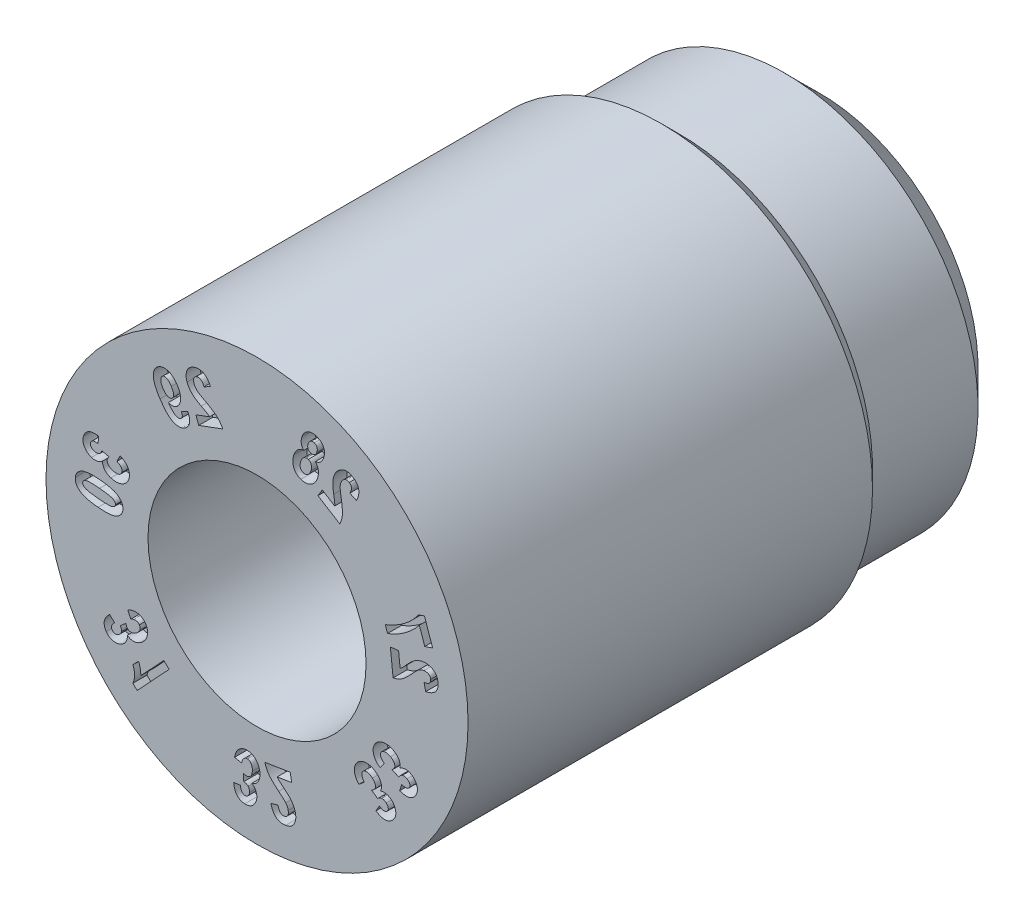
from build123d import *

# Parameters (mm, degrees)
CUT_EXTRUDE2_DEPTH = 0.2


with BuildPart() as part:
    # Sketch2 → Revolve1 (revolve)
    with BuildSketch(Plane(origin=(0, 0, 0), x_dir=(1, 0, 0), z_dir=(0, 1, 0)), mode=Mode.PRIVATE) as revolve1_sk:
        Polygon((2.249621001, 7.999984), (0.8, 7.999984), (0.8, 5.499984), (1.55, 5.499984), (1.55, 0), (3, 0), (3, 5.749984), (2.75, 5.999984), (2.75, 7.499605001), align=None)
    revolve(revolve1_sk.sketch.rotate(Axis((0, 0, -4.849143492), (0, 0, 1)), 180), axis=Axis((0, 0, -4.849143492), (0, 0, 1)))

    # Sketch8 → Cut-Extrude2 (cut)
    # profile 1 of 14: a face of its own
    with BuildSketch(Plane.XY):
        with BuildLine():
            Line((2.012147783, 0.393334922), (1.895227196, 0.380620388))
            Line((1.895227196, 0.380620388), (1.934583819, 0.018743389))
            add(Edge.make_bspline(
                [(1.934583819, 0.018743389), (1.94540127, 0.021160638), (1.966981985, 0.025983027), (1.998152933, 0.037216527), (2.028300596, 0.050939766), (2.052562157, 0.065038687), (2.071942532, 0.078464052), (2.087650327, 0.09028007), (2.104151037, 0.104160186), (2.121741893, 0.119805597), (2.140104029, 0.137561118), (2.159770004, 0.156853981), (2.180120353, 0.17833475), (2.193925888, 0.193346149), (2.201068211, 0.201112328)],
                knots=[0, 0, 0, 0, 1.210903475, 2.415741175, 3.614422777, 4.829304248, 5.477408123, 6.191639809, 6.977581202, 7.834306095, 8.765204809, 9.770030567, 10.846320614, 12, 12, 12, 12], degree=3))
            add(Edge.make_bspline(
                [(2.201068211, 0.201112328), (2.206664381, 0.207205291), (2.217344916, 0.218833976), (2.232806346, 0.235247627), (2.24678372, 0.24991469), (2.259626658, 0.262554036), (2.270733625, 0.273682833), (2.280583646, 0.282909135), (2.289033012, 0.290324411), (2.294424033, 0.294423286), (2.296824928, 0.296248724)],
                knots=[0, 0, 0, 0, 1.469359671, 2.804336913, 4.005076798, 5.067497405, 6.004650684, 6.797449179, 7.46444311, 8, 8, 8, 8], degree=3))
            add(Edge.make_bspline(
                [(2.296824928, 0.296248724), (2.302990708, 0.300542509), (2.315011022, 0.308913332), (2.334444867, 0.318371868), (2.354196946, 0.325119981), (2.36771221, 0.327230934), (2.374387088, 0.328273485)],
                knots=[0, 0, 0, 0, 1.061115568, 2.068666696, 3.046158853, 4, 4, 4, 4], degree=3))
            add(Edge.make_bspline(
                [(2.374387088, 0.328273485), (2.381164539, 0.328845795), (2.393945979, 0.329925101), (2.41212656, 0.328088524), (2.428055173, 0.323811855), (2.441525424, 0.316575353), (2.452524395, 0.307136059), (2.460822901, 0.295615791), (2.466617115, 0.282363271), (2.46812173, 0.272717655), (2.468895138, 0.267759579)],
                knots=[0, 0, 0, 0, 1.284830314, 2.42303217, 3.43989917, 4.386563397, 5.292301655, 6.158766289, 7.053562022, 8, 8, 8, 8], degree=3))
            add(Edge.make_bspline(
                [(2.468895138, 0.267759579), (2.469200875, 0.26232226), (2.469788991, 0.251863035), (2.466524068, 0.236662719), (2.459466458, 0.223250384), (2.449107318, 0.211471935), (2.435204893, 0.201551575), (2.417901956, 0.193617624), (2.397390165, 0.186852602), (2.382364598, 0.184096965), (2.374363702, 0.182629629)],
                knots=[0, 0, 0, 0, 0.913722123, 1.757635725, 2.579276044, 3.438933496, 4.37433614, 5.431505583, 6.632314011, 8, 8, 8, 8], degree=3))
            Line((2.374363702, 0.182629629), (2.398120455, 0.081579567))
            add(Edge.make_bspline(
                [(2.398120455, 0.081579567), (2.406102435, 0.083329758), (2.42160439, 0.086728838), (2.443826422, 0.093227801), (2.464206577, 0.10089892), (2.482883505, 0.109304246), (2.499707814, 0.118786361), (2.514772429, 0.129186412), (2.528021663, 0.140657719), (2.539488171, 0.153090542), (2.549220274, 0.166435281), (2.557472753, 0.180528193), (2.564101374, 0.19545438), (2.56897026, 0.211228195), (2.572586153, 0.227704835), (2.574339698, 0.245032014), (2.574470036, 0.263166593), (2.573444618, 0.275448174), (2.572918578, 0.281748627)],
                knots=[0, 0, 0, 0, 1.316678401, 2.557146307, 3.727226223, 4.823655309, 5.854584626, 6.835260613, 7.768888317, 8.673026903, 9.554907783, 10.425565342, 11.300463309, 12.180346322, 13.081818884, 14.014614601, 14.981496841, 16, 16, 16, 16], degree=3))
            add(Edge.make_bspline(
                [(2.572918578, 0.281748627), (2.571992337, 0.288578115), (2.570195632, 0.301825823), (2.565644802, 0.320913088), (2.559304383, 0.338397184), (2.551548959, 0.354546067), (2.54198972, 0.369031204), (2.530972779, 0.382206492), (2.518176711, 0.393681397), (2.504041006, 0.403646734), (2.489019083, 0.412222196), (2.473459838, 0.419337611), (2.457554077, 0.425080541), (2.441336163, 0.429528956), (2.424733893, 0.432401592), (2.407795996, 0.434108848), (2.390493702, 0.434294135), (2.378896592, 0.433268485), (2.373051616, 0.432751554)],
                knots=[0, 0, 0, 0, 1.173652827, 2.276629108, 3.335023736, 4.336619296, 5.321091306, 6.283820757, 7.254537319, 8.239831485, 9.225125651, 10.197062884, 11.150738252, 12.103199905, 13.057936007, 14.017536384, 15.000832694, 16, 16, 16, 16], degree=3))
            add(Edge.make_bspline(
                [(2.373051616, 0.432751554), (2.366388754, 0.431895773), (2.353125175, 0.430192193), (2.333644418, 0.425796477), (2.314578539, 0.420232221), (2.29590054, 0.413415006), (2.277550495, 0.40503767), (2.259369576, 0.395251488), (2.241261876, 0.383948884), (2.226235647, 0.373348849), (2.213984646, 0.363795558), (2.204275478, 0.355377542), (2.193931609, 0.346030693), (2.183050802, 0.335614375), (2.171517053, 0.324356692), (2.159568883, 0.311877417), (2.146945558, 0.298487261), (2.138439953, 0.289097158), (2.134074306, 0.284277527)],
                knots=[0, 0, 0, 0, 1.116805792, 2.223195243, 3.31725657, 4.418851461, 5.527133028, 6.669491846, 7.850789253, 9.075422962, 9.72636706, 10.433968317, 11.212223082, 12.045064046, 12.93920453, 13.892729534, 14.918407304, 16, 16, 16, 16], degree=3))
            add(Edge.make_bspline(
                [(2.134074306, 0.284277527), (2.130030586, 0.279817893), (2.122326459, 0.271321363), (2.111292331, 0.259257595), (2.101183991, 0.24860097), (2.092495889, 0.238872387), (2.084464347, 0.230806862), (2.077826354, 0.223720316), (2.072046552, 0.218112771), (2.063443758, 0.209806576), (2.051444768, 0.199349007), (2.03992651, 0.191869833), (2.034393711, 0.188277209)],
                knots=[0, 0, 0, 0, 1.30077431, 2.478245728, 3.532467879, 4.474445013, 5.295791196, 5.991390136, 6.572169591, 7.035389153, 8.575948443, 10, 10, 10, 10], degree=3))
            Line((2.034393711, 0.188277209), (2.012147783, 0.393334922))
        make_face()
    # profile 2 of 14: a face of its own
    with BuildSketch(Plane.XY):
        with BuildLine():
            Line((2.384485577, 0.629949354), (2.495904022, 0.668148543))
            Line((2.495904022, 0.668148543), (2.380520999, 1.00450705))
            Line((2.380520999, 1.00450705), (2.2934471, 0.974700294))
            add(Edge.make_bspline(
                [(2.2934471, 0.974700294), (2.290298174, 0.969690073), (2.283826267, 0.959392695), (2.272738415, 0.944136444), (2.260648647, 0.928231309), (2.246983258, 0.911969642), (2.232279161, 0.895053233), (2.216079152, 0.877801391), (2.198661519, 0.860042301), (2.173654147, 0.835611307), (2.140422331, 0.805538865), (2.097979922, 0.77118029), (2.052924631, 0.738909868), (2.013825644, 0.713464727), (1.981743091, 0.694547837), (1.958080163, 0.680915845), (1.934576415, 0.668570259), (1.911562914, 0.656890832), (1.888870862, 0.646199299), (1.866503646, 0.636492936), (1.844549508, 0.627654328), (1.82988145, 0.622486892), (1.822663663, 0.619944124)],
                knots=[0, 0, 0, 0, 0.592925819, 1.218625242, 1.889308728, 2.594945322, 3.346961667, 4.135506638, 4.966343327, 5.83992233, 7.639133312, 9.456054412, 11.30963279, 13.191274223, 14.129172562, 15.042249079, 15.927901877, 16.789598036, 17.628694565, 18.441505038, 19.233103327, 20, 20, 20, 20], degree=3))
            Line((1.822663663, 0.619944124), (1.855142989, 0.525280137))
            add(Edge.make_bspline(
                [(1.855142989, 0.525280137), (1.866122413, 0.529436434), (1.888131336, 0.537767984), (1.920441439, 0.55207819), (1.952496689, 0.567185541), (1.984065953, 0.583568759), (2.01514336, 0.601179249), (2.045972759, 0.61970524), (2.076139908, 0.639734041), (2.10595163, 0.660610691), (2.134962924, 0.682463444), (2.162920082, 0.705079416), (2.189965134, 0.728168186), (2.215653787, 0.752097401), (2.240364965, 0.776562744), (2.264085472, 0.80148986), (2.286496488, 0.827232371), (2.300668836, 0.844897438), (2.307723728, 0.853690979)],
                knots=[0, 0, 0, 0, 0.995463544, 1.995467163, 2.995843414, 4.000594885, 5.010980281, 6.024906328, 7.050248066, 8.081250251, 9.111188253, 10.129832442, 11.130581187, 12.126361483, 13.106449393, 14.079395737, 15.043937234, 16, 16, 16, 16], degree=3))
            Line((2.307723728, 0.853690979), (2.384485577, 0.629949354))
        make_face()
    # profile 3 of 14: a face of its own
    with BuildSketch(Plane.XY):
        with BuildLine():
            Line((0.927892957, 1.828795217), (0.865636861, 1.728335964))
            Line((0.865636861, 1.728335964), (1.176881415, 1.53555217))
            add(Edge.make_bspline(
                [(1.176881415, 1.53555217), (1.181641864, 1.545657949), (1.191100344, 1.565737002), (1.20170019, 1.59733019), (1.209257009, 1.629726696), (1.213183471, 1.657645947), (1.21480779, 1.681296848), (1.214872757, 1.701069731), (1.214118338, 1.722764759), (1.212521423, 1.746374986), (1.210154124, 1.77195242), (1.20672347, 1.799464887), (1.202608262, 1.82894511), (1.199201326, 1.849190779), (1.197441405, 1.859649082)],
                knots=[0, 0, 0, 0, 1.213791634, 2.41166839, 3.614883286, 4.826605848, 5.472644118, 6.191183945, 6.975341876, 7.832633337, 8.763817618, 9.767857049, 10.846942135, 12, 12, 12, 12], degree=3))
            add(Edge.make_bspline(
                [(1.197441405, 1.859649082), (1.196098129, 1.867856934), (1.193537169, 1.883505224), (1.189995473, 1.90586056), (1.187233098, 1.926030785), (1.184793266, 1.943968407), (1.183137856, 1.959717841), (1.181891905, 1.97321175), (1.181348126, 1.98450699), (1.18137385, 1.991300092), (1.181385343, 1.994335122)],
                knots=[0, 0, 0, 0, 1.47009808, 2.802745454, 4.00049633, 5.068537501, 6.002265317, 6.799400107, 7.463594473, 8, 8, 8, 8], degree=3))
            add(Edge.make_bspline(
                [(1.181385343, 1.994335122), (1.181777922, 2.00188581), (1.182545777, 2.016654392), (1.187148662, 2.037909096), (1.193840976, 2.057819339), (1.200596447, 2.069761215), (1.203940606, 2.075672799)],
                knots=[0, 0, 0, 0, 1.061112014, 2.075455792, 3.047293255, 4, 4, 4, 4], degree=3))
            add(Edge.make_bspline(
                [(1.203940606, 2.075672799), (1.207665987, 2.08139441), (1.214711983, 2.092215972), (1.227486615, 2.105410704), (1.240658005, 2.115569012), (1.254796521, 2.121565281), (1.269069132, 2.124481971), (1.283324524, 2.12411296), (1.297371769, 2.120279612), (1.30593105, 2.115562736), (1.310352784, 2.113125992)],
                knots=[0, 0, 0, 0, 1.282396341, 2.425458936, 3.44098324, 4.391968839, 5.288991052, 6.164980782, 7.052026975, 8, 8, 8, 8], degree=3))
            add(Edge.make_bspline(
                [(1.310352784, 2.113125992), (1.314862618, 2.109996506), (1.323532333, 2.103980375), (1.333547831, 2.091963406), (1.339915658, 2.078139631), (1.342727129, 2.062592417), (1.341947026, 2.045467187), (1.337652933, 2.02676509), (1.330161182, 2.006421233), (1.323024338, 1.992844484), (1.319240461, 1.98564624)],
                knots=[0, 0, 0, 0, 0.915994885, 1.760910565, 2.583475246, 3.437762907, 4.380957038, 5.433962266, 6.639514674, 8, 8, 8, 8], degree=3))
            Line((1.319240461, 1.98564624), (1.414177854, 1.941732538))
            add(Edge.make_bspline(
                [(1.414177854, 1.941732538), (1.417765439, 1.949140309), (1.424729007, 1.963518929), (1.432996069, 1.985286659), (1.439804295, 2.006053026), (1.444742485, 2.026044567), (1.447399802, 2.045267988), (1.448638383, 2.063662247), (1.447706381, 2.081286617), (1.444931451, 2.098078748), (1.440422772, 2.11409769), (1.434384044, 2.129396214), (1.426544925, 2.143857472), (1.417155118, 2.157580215), (1.40618442, 2.170561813), (1.393627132, 2.182816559), (1.379406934, 2.194212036), (1.369023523, 2.20094566), (1.363720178, 2.20438487)],
                knots=[0, 0, 0, 0, 1.31786417, 2.55799868, 3.726190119, 4.817613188, 5.851082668, 6.831217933, 7.766471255, 8.671320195, 9.55211188, 10.4274872, 11.300405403, 12.181284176, 13.086669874, 14.018471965, 14.987931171, 16, 16, 16, 16], degree=3))
            add(Edge.make_bspline(
                [(1.363720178, 2.20438487), (1.357756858, 2.207879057), (1.346124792, 2.214694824), (1.328200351, 2.222903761), (1.310341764, 2.228647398), (1.292762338, 2.232508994), (1.275317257, 2.233820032), (1.258065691, 2.233463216), (1.241090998, 2.2302558), (1.224458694, 2.225276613), (1.208440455, 2.218586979), (1.193166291, 2.210684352), (1.178688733, 2.201743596), (1.165134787, 2.191550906), (1.152536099, 2.180182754), (1.140788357, 2.167695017), (1.129893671, 2.154126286), (1.123483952, 2.144320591), (1.120255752, 2.139382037)],
                knots=[0, 0, 0, 0, 1.170055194, 2.282312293, 3.330140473, 4.342005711, 5.322195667, 6.286365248, 7.255265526, 8.237145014, 9.222307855, 10.190116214, 11.146996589, 12.100436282, 13.057913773, 14.01709101, 15.001325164, 16, 16, 16, 16], degree=3))
            add(Edge.make_bspline(
                [(1.120255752, 2.139382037), (1.116788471, 2.133574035), (1.109895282, 2.122027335), (1.10132761, 2.103840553), (1.093791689, 2.085352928), (1.087870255, 2.066243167), (1.082998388, 2.046574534), (1.079586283, 2.026072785), (1.077335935, 2.004718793), (1.076406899, 1.986236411), (1.076418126, 1.970586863), (1.077044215, 1.957684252), (1.078045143, 1.943706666), (1.079350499, 1.928636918), (1.081244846, 1.912516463), (1.083708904, 1.895311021), (1.086486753, 1.877022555), (1.088680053, 1.864503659), (1.089806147, 1.858076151)],
                knots=[0, 0, 0, 0, 1.118093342, 2.222845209, 3.321014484, 4.417594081, 5.528398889, 6.669989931, 7.851820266, 9.07813363, 9.728628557, 10.439317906, 11.214013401, 12.046278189, 12.940768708, 13.898053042, 14.920808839, 16, 16, 16, 16], degree=3))
            add(Edge.make_bspline(
                [(1.089806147, 1.858076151), (1.090897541, 1.852128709), (1.092975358, 1.840805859), (1.095494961, 1.82454441), (1.098122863, 1.810007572), (1.099945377, 1.796986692), (1.101768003, 1.785683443), (1.1031857, 1.775985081), (1.103997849, 1.767918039), (1.10526207, 1.755933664), (1.105988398, 1.739921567), (1.104884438, 1.726123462), (1.104354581, 1.719500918)],
                knots=[0, 0, 0, 0, 1.297620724, 2.470434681, 3.531265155, 4.467489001, 5.29165864, 5.988491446, 6.570479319, 7.031353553, 8.575167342, 10, 10, 10, 10], degree=3))
            Line((1.104354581, 1.719500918), (0.927892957, 1.828795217))
        make_face()
    # profile 4 of 14: a face of its own
    with BuildSketch(Plane.XY):
        with BuildLine():
            add(Edge.make_bspline(
                [(0.828774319, 2.128468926), (0.835667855, 2.129776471), (0.849190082, 2.132341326), (0.868329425, 2.139285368), (0.885781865, 2.148711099), (0.901498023, 2.160667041), (0.915578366, 2.175091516), (0.927729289, 2.192119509), (0.938326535, 2.211444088), (0.943651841, 2.225531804), (0.946397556, 2.232795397)],
                knots=[0, 0, 0, 0, 1.012172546, 1.985458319, 2.926955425, 3.866905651, 4.826770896, 5.826960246, 6.879586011, 8, 8, 8, 8], degree=3))
            add(Edge.make_bspline(
                [(0.946397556, 2.232795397), (0.94838557, 2.238840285), (0.952264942, 2.250636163), (0.956054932, 2.268479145), (0.958479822, 2.285810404), (0.95906851, 2.302663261), (0.958270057, 2.319017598), (0.955532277, 2.334803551), (0.95131095, 2.350157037), (0.945448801, 2.36493869), (0.93800839, 2.378915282), (0.929297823, 2.391989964), (0.919046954, 2.403915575), (0.90751155, 2.414877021), (0.894506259, 2.424712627), (0.880102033, 2.433353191), (0.864403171, 2.441090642), (0.853258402, 2.445274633), (0.847542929, 2.447420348)],
                knots=[0, 0, 0, 0, 1.143314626, 2.23104236, 3.274483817, 4.28594678, 5.258475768, 6.213052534, 7.160210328, 8.116978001, 9.065597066, 10.002221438, 10.935676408, 11.886906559, 12.858242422, 13.860780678, 14.902924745, 16, 16, 16, 16], degree=3))
            add(Edge.make_bspline(
                [(0.847542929, 2.447420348), (0.841404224, 2.44935071), (0.829473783, 2.453102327), (0.8115465, 2.456958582), (0.794208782, 2.458750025), (0.777449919, 2.458947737), (0.761285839, 2.457131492), (0.745809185, 2.453241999), (0.730815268, 2.447922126), (0.716726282, 2.440341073), (0.703382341, 2.431533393), (0.690971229, 2.421613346), (0.679594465, 2.410648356), (0.669330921, 2.398532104), (0.659831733, 2.385513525), (0.651703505, 2.371201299), (0.644256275, 2.356043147), (0.640340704, 2.345315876), (0.638354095, 2.339873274)],
                knots=[0, 0, 0, 0, 1.163481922, 2.261202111, 3.309622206, 4.310939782, 5.287237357, 6.24182584, 7.191827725, 8.156740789, 9.126976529, 10.080745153, 11.026207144, 11.979804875, 12.949536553, 13.936096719, 14.952855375, 16, 16, 16, 16], degree=3))
            add(Edge.make_bspline(
                [(0.638354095, 2.339873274), (0.636017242, 2.332412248), (0.63146809, 2.317887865), (0.627973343, 2.295862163), (0.627083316, 2.274544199), (0.629538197, 2.254109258), (0.634512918, 2.234744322), (0.641997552, 2.21673005), (0.651724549, 2.199899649), (0.660118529, 2.190095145), (0.664358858, 2.185142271)],
                knots=[0, 0, 0, 0, 1.134971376, 2.209449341, 3.230758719, 4.226332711, 5.189212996, 6.127582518, 7.05412376, 8, 8, 8, 8], degree=3))
            add(Edge.make_bspline(
                [(0.664358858, 2.185142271), (0.656095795, 2.183828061), (0.639944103, 2.181259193), (0.617071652, 2.173276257), (0.596155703, 2.162367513), (0.577410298, 2.148056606), (0.560771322, 2.130640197), (0.5460001, 2.110218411), (0.533317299, 2.086537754), (0.526826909, 2.069241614), (0.523459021, 2.060266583)],
                knots=[0, 0, 0, 0, 1.003893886, 1.962297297, 2.896563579, 3.828330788, 4.78288191, 5.78152899, 6.848827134, 8, 8, 8, 8], degree=3))
            add(Edge.make_bspline(
                [(0.523459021, 2.060266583), (0.520406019, 2.050796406), (0.514451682, 2.032326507), (0.509533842, 2.004259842), (0.507585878, 1.977007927), (0.509077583, 1.95068954), (0.513456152, 1.925635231), (0.521267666, 1.902346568), (0.531685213, 1.880797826), (0.545329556, 1.861455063), (0.561402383, 1.844376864), (0.579862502, 1.829785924), (0.600439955, 1.817587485), (0.615487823, 1.81183533), (0.623117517, 1.808918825)],
                knots=[0, 0, 0, 0, 1.179195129, 2.299810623, 3.370701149, 4.41398221, 5.419420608, 6.37861497, 7.319026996, 8.248880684, 9.175410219, 10.09166538, 11.032420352, 12, 12, 12, 12], degree=3))
            add(Edge.make_bspline(
                [(0.623117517, 1.808918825), (0.629217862, 1.807000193), (0.641244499, 1.803217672), (0.659541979, 1.799602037), (0.67758529, 1.797970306), (0.695373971, 1.798010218), (0.712875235, 1.800157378), (0.730161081, 1.80418997), (0.747168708, 1.810054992), (0.763816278, 1.817808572), (0.779755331, 1.827310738), (0.794695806, 1.838526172), (0.808570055, 1.851309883), (0.821088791, 1.865964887), (0.83275864, 1.882004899), (0.843055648, 1.899847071), (0.852150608, 1.919321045), (0.857263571, 1.933065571), (0.859883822, 1.940109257)],
                knots=[0, 0, 0, 0, 1.008189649, 1.987613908, 2.934944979, 3.862038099, 4.788194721, 5.709789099, 6.65712017, 7.620798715, 8.601614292, 9.578681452, 10.56272739, 11.570917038, 12.613966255, 13.687518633, 14.814917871, 16, 16, 16, 16], degree=3))
            add(Edge.make_bspline(
                [(0.859883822, 1.940109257), (0.862785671, 1.949244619), (0.868411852, 1.966956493), (0.87289675, 1.993809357), (0.874151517, 2.019621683), (0.871724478, 2.044380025), (0.866103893, 2.06792723), (0.856974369, 2.089922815), (0.844730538, 2.110492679), (0.834149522, 2.122413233), (0.828774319, 2.128468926)],
                knots=[0, 0, 0, 0, 1.140493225, 2.21121769, 3.232402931, 4.210277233, 5.164501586, 6.105041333, 7.037352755, 8, 8, 8, 8], degree=3))
        make_face()
        with BuildLine():
            add(Edge.make_bspline(
                [(0.850378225, 2.25622326), (0.848214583, 2.250488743), (0.844126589, 2.239653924), (0.835582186, 2.225337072), (0.82553619, 2.213894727), (0.814093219, 2.205394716), (0.801756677, 2.199928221), (0.788975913, 2.197437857), (0.77587538, 2.19761627), (0.767463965, 2.20001906), (0.763145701, 2.201252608)],
                knots=[0, 0, 0, 0, 1.266329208, 2.392607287, 3.429211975, 4.397375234, 5.318939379, 6.19663583, 7.07418644, 8, 8, 8, 8], degree=3))
            add(Edge.make_bspline(
                [(0.763145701, 2.201252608), (0.758904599, 2.202947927), (0.75062419, 2.2062579), (0.740100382, 2.214384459), (0.731384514, 2.2242581), (0.725053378, 2.236252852), (0.720882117, 2.249897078), (0.720179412, 2.265159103), (0.722146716, 2.281680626), (0.725565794, 2.292778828), (0.727365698, 2.298621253)],
                knots=[0, 0, 0, 0, 0.935410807, 1.826313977, 2.705162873, 3.626358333, 4.594547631, 5.615636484, 6.744799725, 8, 8, 8, 8], degree=3))
            add(Edge.make_bspline(
                [(0.727365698, 2.298621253), (0.729494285, 2.304160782), (0.733544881, 2.314702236), (0.741993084, 2.328564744), (0.751820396, 2.339873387), (0.763303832, 2.347997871), (0.775491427, 2.353608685), (0.788185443, 2.356307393), (0.801211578, 2.356226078), (0.809517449, 2.353787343), (0.813771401, 2.352538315)],
                knots=[0, 0, 0, 0, 1.243963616, 2.367202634, 3.391109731, 4.367166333, 5.298014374, 6.189808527, 7.072888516, 8, 8, 8, 8], degree=3))
            add(Edge.make_bspline(
                [(0.813771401, 2.352538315), (0.81807223, 2.350773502), (0.826393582, 2.347358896), (0.837227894, 2.33934192), (0.845910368, 2.329255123), (0.852187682, 2.317148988), (0.856188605, 2.30355852), (0.857154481, 2.288611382), (0.855428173, 2.272531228), (0.852115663, 2.261834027), (0.850378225, 2.25622326)],
                knots=[0, 0, 0, 0, 0.961084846, 1.85953116, 2.765529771, 3.698008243, 4.666599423, 5.682314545, 6.784355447, 8, 8, 8, 8], degree=3))
        make_face(mode=Mode.SUBTRACT)
        with BuildLine():
            add(Edge.make_bspline(
                [(0.766800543, 1.985067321), (0.765321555, 1.981022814), (0.762433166, 1.973124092), (0.757585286, 1.961843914), (0.752056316, 1.951640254), (0.746361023, 1.94230317), (0.740171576, 1.933936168), (0.733505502, 1.926588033), (0.726551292, 1.919960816), (0.716733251, 1.912942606), (0.704186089, 1.906173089), (0.688602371, 1.901825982), (0.672974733, 1.900944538), (0.663132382, 1.90364493), (0.65817463, 1.905005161)],
                knots=[0, 0, 0, 0, 1.031174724, 2.013832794, 2.936515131, 3.807726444, 4.631127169, 5.42398422, 6.181460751, 6.925926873, 8.308731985, 9.570186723, 10.776063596, 12, 12, 12, 12], degree=3))
            add(Edge.make_bspline(
                [(0.65817463, 1.905005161), (0.653424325, 1.906986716), (0.644078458, 1.910885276), (0.632256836, 1.920716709), (0.622847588, 1.933214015), (0.617365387, 1.945684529), (0.614253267, 1.95679567), (0.612779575, 1.965992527), (0.612282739, 1.975810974), (0.612845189, 1.986188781), (0.614052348, 1.997169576), (0.616390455, 2.008723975), (0.619441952, 2.020901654), (0.622140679, 2.029105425), (0.62352735, 2.033320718)],
                knots=[0, 0, 0, 0, 1.239140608, 2.437915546, 3.666282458, 4.994483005, 5.705022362, 6.453910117, 7.242165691, 8.078158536, 8.965240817, 9.911778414, 10.927022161, 12, 12, 12, 12], degree=3))
            add(Edge.make_bspline(
                [(0.62352735, 2.033320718), (0.626210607, 2.040342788), (0.631324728, 2.053726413), (0.641848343, 2.071551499), (0.654010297, 2.086321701), (0.66807434, 2.097392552), (0.682950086, 2.105158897), (0.698272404, 2.109335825), (0.71385102, 2.109777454), (0.723698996, 2.107081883), (0.72869004, 2.105715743)],
                knots=[0, 0, 0, 0, 1.265718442, 2.412379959, 3.474500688, 4.473264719, 5.409681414, 6.285946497, 7.131302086, 8, 8, 8, 8], degree=3))
            add(Edge.make_bspline(
                [(0.72869004, 2.105715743), (0.733411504, 2.103770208), (0.742782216, 2.099908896), (0.754531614, 2.089877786), (0.763985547, 2.077127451), (0.770792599, 2.061782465), (0.77510145, 2.04444097), (0.775563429, 2.025551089), (0.773136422, 2.005421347), (0.768975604, 1.992054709), (0.766800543, 1.985067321)],
                knots=[0, 0, 0, 0, 0.865733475, 1.718225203, 2.593105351, 3.552780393, 4.560480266, 5.618514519, 6.755082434, 8, 8, 8, 8], degree=3))
        make_face(mode=Mode.SUBTRACT)
    # profile 5 of 14: a face of its own
    with BuildSketch(Plane.XY):
        with BuildLine():
            Line((-0.869205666, 1.856581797), (-0.828454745, 1.746287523))
            Line((-0.828454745, 1.746287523), (-0.487103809, 1.872365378))
            add(Edge.make_bspline(
                [(-0.487103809, 1.872365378), (-0.492094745, 1.88225344), (-0.502036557, 1.901950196), (-0.52026244, 1.929599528), (-0.541079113, 1.95532629), (-0.560457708, 1.97557061), (-0.578033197, 1.991256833), (-0.593485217, 2.00341338), (-0.610863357, 2.016217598), (-0.630480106, 2.029304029), (-0.652013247, 2.043060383), (-0.675615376, 2.057244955), (-0.70123, 2.071973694), (-0.719135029, 2.081685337), (-0.728413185, 2.086717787)],
                knots=[0, 0, 0, 0, 1.210854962, 2.411990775, 3.61380145, 4.827105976, 5.47284646, 6.189231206, 6.976933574, 7.833555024, 8.768129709, 9.771909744, 10.845432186, 12, 12, 12, 12], degree=3))
            add(Edge.make_bspline(
                [(-0.728413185, 2.086717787), (-0.735671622, 2.090673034), (-0.749541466, 2.098230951), (-0.769257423, 2.109138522), (-0.786830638, 2.119231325), (-0.802385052, 2.128269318), (-0.815739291, 2.136582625), (-0.827113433, 2.143789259), (-0.836341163, 2.150191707), (-0.841655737, 2.154350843), (-0.844028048, 2.156207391)],
                knots=[0, 0, 0, 0, 1.469278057, 2.807582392, 4.004834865, 5.071359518, 6.004871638, 6.800639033, 7.464631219, 8, 8, 8, 8], degree=3))
            add(Edge.make_bspline(
                [(-0.844028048, 2.156207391), (-0.849690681, 2.161155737), (-0.860773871, 2.170840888), (-0.874584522, 2.187467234), (-0.886082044, 2.204936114), (-0.891341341, 2.21754287), (-0.893957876, 2.223814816)],
                knots=[0, 0, 0, 0, 1.060218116, 2.075112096, 3.042355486, 4, 4, 4, 4], degree=3))
            add(Edge.make_bspline(
                [(-0.893957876, 2.223814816), (-0.896095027, 2.230252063), (-0.900134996, 2.242420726), (-0.903111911, 2.260499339), (-0.902553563, 2.277027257), (-0.898955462, 2.291848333), (-0.892458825, 2.304799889), (-0.883304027, 2.315605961), (-0.871788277, 2.324414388), (-0.862809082, 2.328244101), (-0.858162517, 2.330225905)],
                knots=[0, 0, 0, 0, 1.281795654, 2.42304472, 3.444932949, 4.389250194, 5.286285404, 6.159474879, 7.04756268, 8, 8, 8, 8], degree=3))
            add(Edge.make_bspline(
                [(-0.858162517, 2.330225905), (-0.852944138, 2.331872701), (-0.842953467, 2.33502552), (-0.827428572, 2.335461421), (-0.812684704, 2.332038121), (-0.798818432, 2.324646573), (-0.785815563, 2.313633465), (-0.773876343, 2.298809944), (-0.762560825, 2.280455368), (-0.756214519, 2.266569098), (-0.752836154, 2.259176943)],
                knots=[0, 0, 0, 0, 0.917995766, 1.757518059, 2.580035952, 3.440045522, 4.37817056, 5.430832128, 6.632340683, 8, 8, 8, 8], degree=3))
            Line((-0.752836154, 2.259176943), (-0.66043747, 2.306666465))
            add(Edge.make_bspline(
                [(-0.66043747, 2.306666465), (-0.664079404, 2.313976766), (-0.671158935, 2.328187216), (-0.682932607, 2.348081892), (-0.694965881, 2.366201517), (-0.707933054, 2.382051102), (-0.721059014, 2.396254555), (-0.7349162, 2.408306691), (-0.749162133, 2.418515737), (-0.76405514, 2.42658019), (-0.779402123, 2.432718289), (-0.795087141, 2.437223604), (-0.81119942, 2.440062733), (-0.827682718, 2.441037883), (-0.844604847, 2.440347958), (-0.861855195, 2.437905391), (-0.879490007, 2.433631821), (-0.891132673, 2.429670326), (-0.897084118, 2.427645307)],
                knots=[0, 0, 0, 0, 1.315340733, 2.556882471, 3.722018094, 4.815589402, 5.852468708, 6.833993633, 7.768961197, 8.670525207, 9.555177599, 10.426871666, 11.295236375, 12.185338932, 13.08169562, 14.01942528, 14.987578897, 16, 16, 16, 16], degree=3))
            add(Edge.make_bspline(
                [(-0.897084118, 2.427645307), (-0.903488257, 2.425095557), (-0.915932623, 2.420140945), (-0.933277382, 2.411036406), (-0.948759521, 2.400683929), (-0.962505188, 2.389235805), (-0.974360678, 2.376493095), (-0.984258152, 2.362525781), (-0.992342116, 2.347425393), (-0.998631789, 2.33135687), (-1.00296425, 2.314648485), (-1.006482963, 2.297902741), (-1.00807253, 2.281075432), (-1.008522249, 2.26426726), (-1.007390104, 2.247441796), (-1.004605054, 2.230621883), (-1.000758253, 2.213719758), (-0.996909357, 2.202708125), (-0.99496577, 2.197147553)],
                knots=[0, 0, 0, 0, 1.173907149, 2.281107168, 3.330271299, 4.341955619, 5.322241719, 6.287090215, 7.250438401, 8.233906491, 9.219167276, 10.188532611, 11.146158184, 12.094311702, 13.051211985, 14.013959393, 14.997103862, 16, 16, 16, 16], degree=3))
            add(Edge.make_bspline(
                [(-0.99496577, 2.197147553), (-0.992502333, 2.19089325), (-0.987605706, 2.178461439), (-0.978800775, 2.160502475), (-0.968763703, 2.143351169), (-0.95740287, 2.126970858), (-0.94484647, 2.11121673), (-0.930889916, 2.095960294), (-0.915623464, 2.081103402), (-0.9015982, 2.069207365), (-0.889324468, 2.059698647), (-0.878881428, 2.052229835), (-0.867307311, 2.044533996), (-0.854764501, 2.036328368), (-0.840910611, 2.028070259), (-0.826005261, 2.019435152), (-0.810011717, 2.010377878), (-0.798880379, 2.004465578), (-0.793125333, 2.001408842)],
                knots=[0, 0, 0, 0, 1.118504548, 2.223275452, 3.325218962, 4.423196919, 5.538413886, 6.675910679, 7.862630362, 9.081801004, 9.734684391, 10.446554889, 11.218198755, 12.048073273, 12.94098919, 13.902189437, 14.915404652, 16, 16, 16, 16], degree=3))
            add(Edge.make_bspline(
                [(-0.793125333, 2.001408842), (-0.787808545, 1.998552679), (-0.777686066, 1.993114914), (-0.763298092, 1.985316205), (-0.750368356, 1.978303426), (-0.738979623, 1.971925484), (-0.729090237, 1.966230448), (-0.720566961, 1.961564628), (-0.713669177, 1.957383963), (-0.703603, 1.950941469), (-0.690597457, 1.941796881), (-0.680487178, 1.932520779), (-0.675631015, 1.928065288)],
                knots=[0, 0, 0, 0, 1.303090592, 2.480916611, 3.533487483, 4.478874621, 5.29907776, 5.997407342, 6.576536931, 7.040000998, 8.578255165, 10, 10, 10, 10], degree=3))
            Line((-0.675631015, 1.928065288), (-0.869205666, 1.856581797))
        make_face()
    # profile 6 of 14: a face of its own
    with BuildSketch(Plane.XY):
        with BuildLine():
            Line((-0.984692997, 1.839631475), (-1.0770975, 1.795983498))
            add(Edge.make_bspline(
                [(-1.0770975, 1.795983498), (-1.074536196, 1.790749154), (-1.069694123, 1.780853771), (-1.064862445, 1.76601697), (-1.062083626, 1.752345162), (-1.062029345, 1.739754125), (-1.064332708, 1.728233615), (-1.069222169, 1.717914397), (-1.076755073, 1.708934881), (-1.083133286, 1.7042807), (-1.086432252, 1.701873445)],
                knots=[0, 0, 0, 0, 1.327008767, 2.508673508, 3.547596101, 4.49521526, 5.35960041, 6.204594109, 7.071372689, 8, 8, 8, 8], degree=3))
            add(Edge.make_bspline(
                [(-1.086432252, 1.701873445), (-1.08887034, 1.700409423), (-1.093693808, 1.697513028), (-1.101595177, 1.694540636), (-1.109775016, 1.692764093), (-1.118247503, 1.692037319), (-1.126960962, 1.692776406), (-1.135952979, 1.694566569), (-1.145225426, 1.697600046), (-1.15501065, 1.701772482), (-1.165383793, 1.707793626), (-1.176344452, 1.716117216), (-1.188374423, 1.726468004), (-1.201019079, 1.73930583), (-1.214670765, 1.754231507), (-1.229106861, 1.771461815), (-1.244469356, 1.79094616), (-1.254743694, 1.804891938), (-1.26011422, 1.812181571)],
                knots=[0, 0, 0, 0, 0.604805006, 1.19653528, 1.788036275, 2.38380259, 3.000453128, 3.644083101, 4.332978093, 5.07477737, 5.906515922, 6.88020348, 8.002360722, 9.284552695, 10.715529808, 12.310457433, 14.071429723, 16, 16, 16, 16], degree=3))
            add(Edge.make_bspline(
                [(-1.26011422, 1.812181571), (-1.254994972, 1.810257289), (-1.245027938, 1.806510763), (-1.229838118, 1.802859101), (-1.215039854, 1.800912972), (-1.200598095, 1.800806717), (-1.186548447, 1.802452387), (-1.172901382, 1.806091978), (-1.159568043, 1.811386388), (-1.151288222, 1.816373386), (-1.147098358, 1.818896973)],
                knots=[0, 0, 0, 0, 1.111445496, 2.163953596, 3.169308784, 4.141012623, 5.093998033, 6.036982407, 7.006647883, 8, 8, 8, 8], degree=3))
            add(Edge.make_bspline(
                [(-1.147098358, 1.818896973), (-1.142914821, 1.82185296), (-1.134623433, 1.827711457), (-1.123616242, 1.838254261), (-1.113897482, 1.849996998), (-1.105656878, 1.863184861), (-1.09898881, 1.877766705), (-1.093359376, 1.893496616), (-1.089351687, 1.910611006), (-1.086791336, 1.928797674), (-1.085693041, 1.947778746), (-1.086645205, 1.967198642), (-1.08947698, 1.986853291), (-1.09435921, 2.006652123), (-1.10114442, 2.026639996), (-1.109693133, 2.046893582), (-1.120247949, 2.067329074), (-1.128530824, 2.080604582), (-1.13276023, 2.087383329)],
                knots=[0, 0, 0, 0, 0.824243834, 1.633575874, 2.446605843, 3.274481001, 4.130399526, 5.025050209, 5.961613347, 6.956367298, 7.980756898, 9.019585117, 10.083014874, 11.174832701, 12.299596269, 13.48006686, 14.713270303, 16, 16, 16, 16], degree=3))
            add(Edge.make_bspline(
                [(-1.13276023, 2.087383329), (-1.137553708, 2.094468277), (-1.146891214, 2.108269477), (-1.162026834, 2.127413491), (-1.177758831, 2.144513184), (-1.194159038, 2.159477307), (-1.211037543, 2.172527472), (-1.22843323, 2.18359438), (-1.246455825, 2.192565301), (-1.264916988, 2.199318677), (-1.28346, 2.204072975), (-1.301727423, 2.206983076), (-1.319643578, 2.207981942), (-1.337098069, 2.206711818), (-1.354218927, 2.203807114), (-1.370762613, 2.198427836), (-1.387065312, 2.191406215), (-1.397266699, 2.185216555), (-1.402463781, 2.182063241)],
                knots=[0, 0, 0, 0, 1.283181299, 2.499586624, 3.657949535, 4.765784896, 5.826697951, 6.855467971, 7.85434227, 8.841286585, 9.799348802, 10.722298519, 11.612962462, 12.484942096, 13.343282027, 14.211626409, 15.088915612, 16, 16, 16, 16], degree=3))
            add(Edge.make_bspline(
                [(-1.402463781, 2.182063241), (-1.4080311, 2.178245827), (-1.419008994, 2.170718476), (-1.433164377, 2.156818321), (-1.445487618, 2.141669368), (-1.455672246, 2.124892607), (-1.463459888, 2.106489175), (-1.469377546, 2.08663464), (-1.473096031, 2.065208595), (-1.4748787, 2.042208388), (-1.473852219, 2.017513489), (-1.469830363, 1.991086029), (-1.462312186, 1.963004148), (-1.451944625, 1.933087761), (-1.438424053, 1.901408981), (-1.42169202, 1.868012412), (-1.401820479, 1.832850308), (-1.386873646, 1.809244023), (-1.379116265, 1.796992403)],
                knots=[0, 0, 0, 0, 0.750980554, 1.480817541, 2.201233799, 2.923211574, 3.659581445, 4.422302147, 5.227117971, 6.078485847, 6.988479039, 7.975214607, 9.051314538, 10.22340383, 11.501208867, 12.886677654, 14.38419109, 16, 16, 16, 16], degree=3))
            add(Edge.make_bspline(
                [(-1.379116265, 1.796992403), (-1.370923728, 1.784720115), (-1.355127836, 1.761058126), (-1.330791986, 1.727849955), (-1.306436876, 1.698540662), (-1.28268313, 1.672534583), (-1.25893946, 1.650435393), (-1.235485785, 1.631902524), (-1.212428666, 1.616797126), (-1.189375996, 1.605650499), (-1.16684669, 1.597712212), (-1.144876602, 1.592147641), (-1.123324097, 1.589636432), (-1.102238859, 1.589618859), (-1.08165378, 1.592440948), (-1.061479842, 1.597738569), (-1.041853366, 1.605942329), (-1.029604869, 1.613336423), (-1.023391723, 1.617087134)],
                knots=[0, 0, 0, 0, 1.586783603, 3.059450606, 4.425007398, 5.683294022, 6.844752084, 7.909029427, 8.894933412, 9.802781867, 10.655215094, 11.460369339, 12.234807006, 12.982594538, 13.722043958, 14.462848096, 15.220267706, 16, 16, 16, 16], degree=3))
            add(Edge.make_bspline(
                [(-1.023391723, 1.617087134), (-1.019250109, 1.619933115), (-1.011107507, 1.625528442), (-0.9999753, 1.634982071), (-0.990085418, 1.64514536), (-0.981544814, 1.656094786), (-0.974142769, 1.667615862), (-0.968056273, 1.679902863), (-0.963346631, 1.692923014), (-0.959657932, 1.706590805), (-0.957555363, 1.720986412), (-0.956916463, 1.736015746), (-0.957717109, 1.751721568), (-0.960193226, 1.768069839), (-0.964077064, 1.785089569), (-0.969466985, 1.802743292), (-0.97623897, 1.821116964), (-0.981816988, 1.83333295), (-0.984692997, 1.839631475)],
                knots=[0, 0, 0, 0, 0.96297507, 1.893252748, 2.794897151, 3.677157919, 4.551117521, 5.416273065, 6.299902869, 7.201872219, 8.125986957, 9.082818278, 10.081899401, 11.136174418, 12.248868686, 13.426060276, 14.672884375, 16, 16, 16, 16], degree=3))
        make_face()
        with BuildLine():
            add(Edge.make_bspline(
                [(-1.335368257, 1.944817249), (-1.338084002, 1.949107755), (-1.343355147, 1.957435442), (-1.350210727, 1.970053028), (-1.35592208, 1.982328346), (-1.360629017, 1.994215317), (-1.364159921, 2.005787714), (-1.366549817, 2.016996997), (-1.367749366, 2.027871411), (-1.367881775, 2.038275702), (-1.367221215, 2.048126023), (-1.36561955, 2.057211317), (-1.36340339, 2.065592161), (-1.360514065, 2.073216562), (-1.356686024, 2.080034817), (-1.352251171, 2.086097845), (-1.347049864, 2.091476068), (-1.343019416, 2.09432594), (-1.3409764, 2.095770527)],
                knots=[0, 0, 0, 0, 1.464084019, 2.841724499, 4.137652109, 5.36668594, 6.52575593, 7.622818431, 8.667247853, 9.675254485, 10.620112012, 11.510042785, 12.331295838, 13.117594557, 13.854263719, 14.579023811, 15.279713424, 16, 16, 16, 16], degree=3))
            add(Edge.make_bspline(
                [(-1.3409764, 2.095770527), (-1.336887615, 2.098064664), (-1.32879907, 2.10260299), (-1.314728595, 2.104980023), (-1.299994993, 2.103879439), (-1.287470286, 2.099961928), (-1.277182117, 2.095054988), (-1.269235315, 2.089764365), (-1.261098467, 2.083300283), (-1.252770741, 2.075635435), (-1.244507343, 2.066536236), (-1.235989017, 2.056278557), (-1.227437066, 2.044677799), (-1.221928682, 2.036365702), (-1.219081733, 2.032069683)],
                knots=[0, 0, 0, 0, 1.093960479, 2.164102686, 3.291752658, 4.538764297, 5.220516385, 5.96336915, 6.774472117, 7.659632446, 8.617714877, 9.658545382, 10.789844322, 12, 12, 12, 12], degree=3))
            add(Edge.make_bspline(
                [(-1.219081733, 2.032069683), (-1.216333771, 2.027653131), (-1.21102416, 2.019119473), (-1.203919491, 2.006382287), (-1.197834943, 1.994260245), (-1.193268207, 1.982523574), (-1.189401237, 1.971520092), (-1.186923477, 1.960936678), (-1.185420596, 1.950904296), (-1.185298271, 1.9413771), (-1.186046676, 1.932457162), (-1.187540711, 1.92414017), (-1.189715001, 1.916404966), (-1.192939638, 1.9094262), (-1.196599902, 1.902893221), (-1.201333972, 1.89722599), (-1.206539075, 1.891907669), (-1.210652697, 1.889105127), (-1.212740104, 1.887683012)],
                knots=[0, 0, 0, 0, 1.551722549, 2.99823677, 4.35062199, 5.593993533, 6.753413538, 7.827028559, 8.832285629, 9.773748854, 10.662578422, 11.499280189, 12.292329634, 13.051548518, 13.788474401, 14.518628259, 15.248295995, 16, 16, 16, 16], degree=3))
            add(Edge.make_bspline(
                [(-1.212740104, 1.887683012), (-1.216991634, 1.885378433), (-1.225433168, 1.880802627), (-1.240043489, 1.878094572), (-1.255436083, 1.879413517), (-1.26867231, 1.883011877), (-1.279459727, 1.887811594), (-1.287671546, 1.892726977), (-1.295886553, 1.898627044), (-1.304006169, 1.905625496), (-1.312003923, 1.913860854), (-1.32000124, 1.923109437), (-1.327807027, 1.933566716), (-1.332797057, 1.940991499), (-1.335368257, 1.944817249)],
                knots=[0, 0, 0, 0, 1.152319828, 2.287963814, 3.49513681, 4.82534906, 5.552131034, 6.315778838, 7.112301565, 7.971204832, 8.878235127, 9.85838668, 10.896496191, 12, 12, 12, 12], degree=3))
        make_face(mode=Mode.SUBTRACT)
    # profile 7 of 14: a face of its own
    with BuildSketch(Plane.XY):
        with BuildLine():
            Line((-1.946127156, 0.813093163), (-1.990985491, 0.721379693))
            add(Edge.make_bspline(
                [(-1.990985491, 0.721379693), (-1.984201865, 0.718328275), (-1.97129731, 0.712523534), (-1.954364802, 0.701393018), (-1.940387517, 0.6892934), (-1.930207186, 0.675597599), (-1.923065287, 0.661450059), (-1.919412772, 0.647028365), (-1.918573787, 0.63255229), (-1.921013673, 0.623359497), (-1.92224634, 0.618715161)],
                knots=[0, 0, 0, 0, 1.309095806, 2.490304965, 3.559080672, 4.549503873, 5.478912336, 6.333244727, 7.157930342, 8, 8, 8, 8], degree=3))
            add(Edge.make_bspline(
                [(-1.92224634, 0.618715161), (-1.924153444, 0.613863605), (-1.927920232, 0.604281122), (-1.938044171, 0.592203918), (-1.950999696, 0.582363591), (-1.964115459, 0.576580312), (-1.97571033, 0.573109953), (-1.985135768, 0.571359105), (-1.995017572, 0.570501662), (-2.005362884, 0.570501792), (-2.016167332, 0.571437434), (-2.027427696, 0.573242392), (-2.039178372, 0.575838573), (-2.04704661, 0.57825708), (-2.05106966, 0.579493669)],
                knots=[0, 0, 0, 0, 1.244800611, 2.458650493, 3.726961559, 5.124625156, 5.87313516, 6.631410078, 7.422187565, 8.252254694, 9.112783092, 10.023793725, 10.989560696, 12, 12, 12, 12], degree=3))
            add(Edge.make_bspline(
                [(-2.05106966, 0.579493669), (-2.058303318, 0.582031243), (-2.072077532, 0.586863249), (-2.090470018, 0.596950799), (-2.10569774, 0.60874935), (-2.117274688, 0.62229517), (-2.125517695, 0.636622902), (-2.130050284, 0.651287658), (-2.131361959, 0.666157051), (-2.128909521, 0.675593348), (-2.127669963, 0.680362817)],
                knots=[0, 0, 0, 0, 1.303837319, 2.482745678, 3.556157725, 4.566735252, 5.498744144, 6.350368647, 7.166212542, 8, 8, 8, 8], degree=3))
            add(Edge.make_bspline(
                [(-2.127669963, 0.680362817), (-2.126503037, 0.683676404), (-2.124059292, 0.690615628), (-2.118610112, 0.700889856), (-2.11220843, 0.711910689), (-2.10697866, 0.719119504), (-2.104250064, 0.722880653)],
                knots=[0, 0, 0, 0, 0.863796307, 1.80893909, 2.856829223, 4, 4, 4, 4], degree=3))
            Line((-2.104250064, 0.722880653), (-2.206426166, 0.743616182))
            add(Edge.make_bspline(
                [(-2.206426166, 0.743616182), (-2.208422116, 0.737535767), (-2.212225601, 0.725948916), (-2.221493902, 0.710802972), (-2.23262881, 0.698146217), (-2.241917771, 0.692350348), (-2.24652857, 0.68947343)],
                knots=[0, 0, 0, 0, 1.106846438, 2.109208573, 3.061460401, 4, 4, 4, 4], degree=3))
            add(Edge.make_bspline(
                [(-2.24652857, 0.68947343), (-2.251447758, 0.687325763), (-2.26141867, 0.682972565), (-2.278158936, 0.680524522), (-2.296106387, 0.68188522), (-2.308071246, 0.68514713), (-2.314360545, 0.686861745)],
                knots=[0, 0, 0, 0, 0.921340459, 1.867504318, 2.879058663, 4, 4, 4, 4], degree=3))
            add(Edge.make_bspline(
                [(-2.314360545, 0.686861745), (-2.319461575, 0.688725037), (-2.329203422, 0.692283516), (-2.342248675, 0.699628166), (-2.35282827, 0.708571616), (-2.36074448, 0.718910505), (-2.366280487, 0.730034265), (-2.369048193, 0.741850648), (-2.369090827, 0.754097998), (-2.366997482, 0.762035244), (-2.365927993, 0.766090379)],
                knots=[0, 0, 0, 0, 1.225966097, 2.341326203, 3.36438486, 4.334639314, 5.264664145, 6.15114709, 7.055422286, 8, 8, 8, 8], degree=3))
            add(Edge.make_bspline(
                [(-2.365927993, 0.766090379), (-2.364372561, 0.7701019), (-2.361307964, 0.778005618), (-2.353303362, 0.78815862), (-2.343188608, 0.796732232), (-2.330582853, 0.803244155), (-2.315886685, 0.807784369), (-2.299078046, 0.809309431), (-2.280404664, 0.808169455), (-2.267538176, 0.805597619), (-2.26073756, 0.804238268)],
                knots=[0, 0, 0, 0, 0.832024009, 1.639299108, 2.480992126, 3.392783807, 4.376681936, 5.452384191, 6.653451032, 8, 8, 8, 8], degree=3))
            Line((-2.26073756, 0.804238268), (-2.250321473, 0.902095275))
            add(Edge.make_bspline(
                [(-2.250321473, 0.902095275), (-2.257728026, 0.903099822), (-2.272072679, 0.905045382), (-2.293125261, 0.906222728), (-2.312921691, 0.906533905), (-2.331552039, 0.905201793), (-2.349002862, 0.902787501), (-2.3652556, 0.898815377), (-2.380265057, 0.893540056), (-2.394107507, 0.886984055), (-2.406768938, 0.879158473), (-2.418393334, 0.870238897), (-2.42911215, 0.860384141), (-2.43874884, 0.8493931), (-2.447342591, 0.837335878), (-2.454874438, 0.824153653), (-2.461424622, 0.809940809), (-2.464899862, 0.799922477), (-2.46666125, 0.794844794)],
                knots=[0, 0, 0, 0, 1.342783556, 2.600638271, 3.787067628, 4.898616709, 5.954110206, 6.949688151, 7.900145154, 8.808808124, 9.696941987, 10.569979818, 11.438582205, 12.309589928, 13.192161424, 14.09510333, 15.034523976, 16, 16, 16, 16], degree=3))
            add(Edge.make_bspline(
                [(-2.46666125, 0.794844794), (-2.468371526, 0.789041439), (-2.471714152, 0.777699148), (-2.474507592, 0.760500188), (-2.475377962, 0.743730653), (-2.474471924, 0.727370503), (-2.471903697, 0.711385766), (-2.467087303, 0.695888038), (-2.460493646, 0.680811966), (-2.452220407, 0.666252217), (-2.442527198, 0.652627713), (-2.432201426, 0.639866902), (-2.420968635, 0.628426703), (-2.409058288, 0.618054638), (-2.396319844, 0.608953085), (-2.382771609, 0.601186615), (-2.368571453, 0.594444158), (-2.358628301, 0.590941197), (-2.35361031, 0.589173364)],
                knots=[0, 0, 0, 0, 1.109733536, 2.168904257, 3.189619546, 4.1866037, 5.171695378, 6.153509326, 7.156972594, 8.187216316, 9.221363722, 10.223286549, 11.197409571, 12.160439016, 13.119240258, 14.065953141, 15.023948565, 16, 16, 16, 16], degree=3))
            add(Edge.make_bspline(
                [(-2.35361031, 0.589173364), (-2.346793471, 0.587234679), (-2.333400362, 0.583425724), (-2.312894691, 0.580759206), (-2.292702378, 0.580998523), (-2.272789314, 0.583704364), (-2.253179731, 0.589169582), (-2.233814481, 0.597258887), (-2.214820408, 0.608188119), (-2.202897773, 0.617155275), (-2.196789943, 0.621749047)],
                knots=[0, 0, 0, 0, 1.015158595, 1.994491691, 2.952165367, 3.903033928, 4.867719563, 5.862390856, 6.904927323, 8, 8, 8, 8], degree=3))
            add(Edge.make_bspline(
                [(-2.196789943, 0.621749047), (-2.196884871, 0.617871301), (-2.197074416, 0.610128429), (-2.196084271, 0.598615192), (-2.193978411, 0.587300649), (-2.190880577, 0.576216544), (-2.18674241, 0.565340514), (-2.181581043, 0.554739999), (-2.175406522, 0.544355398), (-2.168112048, 0.534324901), (-2.160085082, 0.524531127), (-2.150845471, 0.515587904), (-2.140899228, 0.507110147), (-2.129974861, 0.499361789), (-2.118201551, 0.492269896), (-2.105517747, 0.485978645), (-2.092058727, 0.480034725), (-2.082561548, 0.4768851), (-2.077704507, 0.475274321)],
                knots=[0, 0, 0, 0, 0.913961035, 1.824947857, 2.71812946, 3.623811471, 4.534555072, 5.457681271, 6.400222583, 7.378744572, 8.379429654, 9.381276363, 10.405646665, 11.458125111, 12.534949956, 13.642405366, 14.794280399, 16, 16, 16, 16], degree=3))
            add(Edge.make_bspline(
                [(-2.077704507, 0.475274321), (-2.070587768, 0.473180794), (-2.056587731, 0.469062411), (-2.03546351, 0.465065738), (-2.014772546, 0.46287023), (-1.994509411, 0.462567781), (-1.974623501, 0.46424535), (-1.95515826, 0.467882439), (-1.936157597, 0.473484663), (-1.91782201, 0.48090813), (-1.900388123, 0.489666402), (-1.884370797, 0.499848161), (-1.869927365, 0.511201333), (-1.857141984, 0.523824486), (-1.845817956, 0.537530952), (-1.836167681, 0.552498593), (-1.82809598, 0.568646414), (-1.824036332, 0.580061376), (-1.821977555, 0.585850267)],
                knots=[0, 0, 0, 0, 1.14742546, 2.257213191, 3.32149137, 4.364021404, 5.388378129, 6.404665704, 7.423228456, 8.448516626, 9.462076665, 10.438362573, 11.380692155, 12.299557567, 13.213605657, 14.126478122, 15.049877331, 16, 16, 16, 16], degree=3))
            add(Edge.make_bspline(
                [(-1.821977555, 0.585850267), (-1.820346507, 0.591486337), (-1.817143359, 0.602554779), (-1.814355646, 0.619395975), (-1.812921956, 0.636019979), (-1.81371939, 0.652531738), (-1.815751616, 0.66887549), (-1.819780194, 0.685001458), (-1.825459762, 0.700923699), (-1.832731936, 0.716614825), (-1.841742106, 0.731694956), (-1.852125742, 0.746113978), (-1.8641361, 0.759577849), (-1.877630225, 0.772156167), (-1.892603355, 0.783812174), (-1.909082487, 0.794465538), (-1.926922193, 0.804479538), (-1.939620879, 0.81017503), (-1.946127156, 0.813093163)],
                knots=[0, 0, 0, 0, 0.982229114, 1.92895884, 2.8551073, 3.772211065, 4.693028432, 5.610589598, 6.550558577, 7.521905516, 8.503108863, 9.489430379, 10.494629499, 11.52073263, 12.576317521, 13.669267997, 14.805830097, 16, 16, 16, 16], degree=3))
        make_face()
    # profile 8 of 14: a face of its own
    with BuildSketch(Plane.XY):
        with BuildLine():
            add(Edge.make_bspline(
                [(-2.583277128, 0.228643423), (-2.583662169, 0.222191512), (-2.58442156, 0.209466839), (-2.582258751, 0.190647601), (-2.578027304, 0.172479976), (-2.57104074, 0.155155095), (-2.56179632, 0.138518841), (-2.549975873, 0.122760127), (-2.535818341, 0.107708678), (-2.519134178, 0.093305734), (-2.499296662, 0.079885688), (-2.475929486, 0.067805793), (-2.448831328, 0.057122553), (-2.418198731, 0.047594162), (-2.383933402, 0.039029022), (-2.34598426, 0.032090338), (-2.3044521, 0.025986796), (-2.275475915, 0.023179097), (-2.260416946, 0.021719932)],
                knots=[0, 0, 0, 0, 0.723859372, 1.427619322, 2.116156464, 2.811075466, 3.515832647, 4.245662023, 5.014928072, 5.830040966, 6.713324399, 7.695373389, 8.774843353, 9.976872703, 11.292124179, 12.734575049, 14.302953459, 16, 16, 16, 16], degree=3))
            add(Edge.make_bspline(
                [(-2.260416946, 0.021719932), (-2.245382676, 0.020521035), (-2.216413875, 0.018210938), (-2.174545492, 0.016655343), (-2.136028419, 0.017198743), (-2.100893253, 0.019156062), (-2.069146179, 0.023390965), (-2.040662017, 0.028983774), (-2.015541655, 0.036753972), (-1.993692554, 0.046426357), (-1.974827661, 0.057763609), (-1.958055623, 0.06980949), (-1.943717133, 0.083336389), (-1.931592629, 0.097963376), (-1.921956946, 0.113880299), (-1.914345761, 0.130780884), (-1.90917837, 0.148934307), (-1.907635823, 0.161521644), (-1.90685272, 0.167911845)],
                knots=[0, 0, 0, 0, 1.695837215, 3.26762594, 4.708978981, 6.026365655, 7.221846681, 8.307844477, 9.286790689, 10.172314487, 10.987422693, 11.75790269, 12.489820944, 13.197797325, 13.887637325, 14.575538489, 15.276845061, 16, 16, 16, 16], degree=3))
            add(Edge.make_bspline(
                [(-1.90685272, 0.167911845), (-1.906483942, 0.174361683), (-1.905757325, 0.187070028), (-1.907682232, 0.205906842), (-1.912016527, 0.22394579), (-1.918684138, 0.241304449), (-1.928026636, 0.257791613), (-1.939561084, 0.273700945), (-1.953649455, 0.288733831), (-1.967207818, 0.300436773), (-1.979308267, 0.30942883), (-1.989563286, 0.315843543), (-2.000654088, 0.322058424), (-2.012804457, 0.327798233), (-2.025695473, 0.333600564), (-2.039715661, 0.338710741), (-2.054575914, 0.343660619), (-2.070373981, 0.348411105), (-2.087133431, 0.352689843), (-2.104821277, 0.356771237), (-2.123440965, 0.360719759), (-2.143057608, 0.363903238), (-2.163552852, 0.367258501), (-2.185005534, 0.370029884), (-2.207390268, 0.372725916), (-2.22263434, 0.374114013), (-2.230395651, 0.374820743)],
                knots=[0, 0, 0, 0, 1.083252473, 2.134370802, 3.164763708, 4.19048497, 5.245151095, 6.337080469, 7.482290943, 8.695662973, 9.339213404, 10.011452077, 10.724877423, 11.472294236, 12.266673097, 13.09724519, 13.975929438, 14.896296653, 15.866027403, 16.879185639, 17.94387043, 19.060621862, 20.215041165, 21.430332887, 22.691689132, 24, 24, 24, 24], degree=3))
            add(Edge.make_bspline(
                [(-2.230395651, 0.374820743), (-2.245386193, 0.376022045), (-2.274223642, 0.378333), (-2.315905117, 0.379732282), (-2.354261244, 0.379505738), (-2.389262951, 0.377124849), (-2.420997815, 0.37330585), (-2.449335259, 0.367298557), (-2.474491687, 0.359825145), (-2.496295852, 0.350084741), (-2.515219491, 0.338782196), (-2.531923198, 0.326587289), (-2.546278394, 0.313091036), (-2.558398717, 0.298505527), (-2.56824975, 0.282741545), (-2.575559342, 0.265698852), (-2.581009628, 0.247644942), (-2.582513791, 0.235040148), (-2.583277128, 0.228643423)],
                knots=[0, 0, 0, 0, 1.694089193, 3.25893554, 4.697174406, 6.013404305, 7.209668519, 8.294956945, 9.273470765, 10.160693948, 10.977366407, 11.75297024, 12.4862931, 13.191245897, 13.884255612, 14.572283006, 15.275457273, 16, 16, 16, 16], degree=3))
        make_face()
        with BuildLine():
            add(Edge.make_bspline(
                [(-2.4780411, 0.219175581), (-2.47769738, 0.221659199), (-2.477010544, 0.226622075), (-2.474299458, 0.233641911), (-2.470526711, 0.240212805), (-2.465414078, 0.246177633), (-2.45905521, 0.251619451), (-2.451448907, 0.256493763), (-2.442683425, 0.260941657), (-2.432405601, 0.265064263), (-2.419663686, 0.268360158), (-2.403879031, 0.270552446), (-2.384669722, 0.271812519), (-2.362105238, 0.272355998), (-2.336068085, 0.272048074), (-2.30665651, 0.270835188), (-2.273819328, 0.268798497), (-2.25082618, 0.266865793), (-2.238759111, 0.265851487)],
                knots=[0, 0, 0, 0, 0.456375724, 0.91195034, 1.363130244, 1.834186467, 2.338209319, 2.885930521, 3.479227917, 4.130581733, 4.903545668, 5.875123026, 7.0353706, 8.416283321, 9.994545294, 11.787894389, 13.789438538, 16, 16, 16, 16], degree=3))
            add(Edge.make_bspline(
                [(-2.238759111, 0.265851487), (-2.226679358, 0.264697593), (-2.203691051, 0.26250168), (-2.17102855, 0.258730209), (-2.141878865, 0.254853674), (-2.116266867, 0.250640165), (-2.094166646, 0.24604524), (-2.075542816, 0.241380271), (-2.060436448, 0.236379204), (-2.048553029, 0.230954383), (-2.039120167, 0.225195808), (-2.031414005, 0.21919088), (-2.024774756, 0.213094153), (-2.019552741, 0.206621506), (-2.015544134, 0.199804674), (-2.013018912, 0.19269851), (-2.011765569, 0.185280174), (-2.011932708, 0.18031867), (-2.012018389, 0.177775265)],
                knots=[0, 0, 0, 0, 2.218555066, 4.222009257, 6.011013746, 7.594541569, 8.966378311, 10.137003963, 11.10320267, 11.871349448, 12.520068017, 13.118799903, 13.655328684, 14.164396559, 14.63362748, 15.094261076, 15.53569309, 16, 16, 16, 16], degree=3))
            add(Edge.make_bspline(
                [(-2.012018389, 0.177775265), (-2.012383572, 0.17525334), (-2.013105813, 0.170265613), (-2.015609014, 0.163064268), (-2.019579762, 0.156536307), (-2.024717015, 0.150489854), (-2.031026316, 0.14499195), (-2.038542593, 0.139938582), (-2.047453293, 0.135823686), (-2.057688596, 0.13160383), (-2.070388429, 0.128318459), (-2.086188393, 0.126300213), (-2.105281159, 0.124802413), (-2.127812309, 0.124475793), (-2.153701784, 0.124668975), (-2.183055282, 0.126107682), (-2.215798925, 0.128034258), (-2.238735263, 0.1300707), (-2.250749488, 0.131137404)],
                knots=[0, 0, 0, 0, 0.465010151, 0.919671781, 1.381810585, 1.853358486, 2.364264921, 2.906638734, 3.502233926, 4.154267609, 4.928038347, 5.890310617, 7.061697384, 8.426438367, 10.006347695, 11.792388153, 13.79602147, 16, 16, 16, 16], degree=3))
            add(Edge.make_bspline(
                [(-2.250749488, 0.131137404), (-2.262838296, 0.132234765), (-2.28584066, 0.134322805), (-2.318502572, 0.138134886), (-2.347654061, 0.141999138), (-2.373306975, 0.146232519), (-2.39545936, 0.150806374), (-2.41409945, 0.155548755), (-2.429298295, 0.160371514), (-2.44124224, 0.165779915), (-2.450646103, 0.171608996), (-2.458538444, 0.177450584), (-2.465059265, 0.183681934), (-2.470522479, 0.19004956), (-2.474323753, 0.196953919), (-2.477011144, 0.204085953), (-2.478295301, 0.211573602), (-2.478126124, 0.2166329), (-2.4780411, 0.219175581)],
                knots=[0, 0, 0, 0, 2.214349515, 4.21342425, 5.99851806, 7.578584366, 8.955562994, 10.123629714, 11.086511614, 11.860857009, 12.50815751, 13.101849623, 13.648485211, 14.15112399, 14.62559144, 15.078164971, 15.536708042, 16, 16, 16, 16], degree=3))
        make_face(mode=Mode.SUBTRACT)
    # profile 9 of 14: a face of its own
    with BuildSketch(Plane.XY):
        with BuildLine():
            Line((-1.83895419, -1.031005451), (-1.794835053, -1.122322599))
            add(Edge.make_bspline(
                [(-1.794835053, -1.122322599), (-1.788248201, -1.118874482), (-1.775734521, -1.112323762), (-1.756630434, -1.105754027), (-1.738526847, -1.102444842), (-1.721572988, -1.102742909), (-1.706151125, -1.10608225), (-1.692447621, -1.111748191), (-1.680738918, -1.120286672), (-1.674956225, -1.127769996), (-1.672038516, -1.131545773)],
                knots=[0, 0, 0, 0, 1.313454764, 2.495296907, 3.558279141, 4.552627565, 5.472934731, 6.333884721, 7.15934671, 8, 8, 8, 8], degree=3))
            add(Edge.make_bspline(
                [(-1.672038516, -1.131545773), (-1.669433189, -1.136023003), (-1.664268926, -1.144897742), (-1.660746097, -1.160208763), (-1.66122188, -1.176405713), (-1.665389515, -1.193246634), (-1.673371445, -1.21027961), (-1.685262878, -1.226846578), (-1.701226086, -1.242483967), (-1.713788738, -1.251629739), (-1.72039869, -1.256441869)],
                knots=[0, 0, 0, 0, 0.830320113, 1.645855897, 2.489630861, 3.418701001, 4.419436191, 5.500262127, 6.684740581, 8, 8, 8, 8], degree=3))
            add(Edge.make_bspline(
                [(-1.72039869, -1.256441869), (-1.726829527, -1.260523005), (-1.739104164, -1.268312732), (-1.758289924, -1.276605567), (-1.776881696, -1.281252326), (-1.794586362, -1.282138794), (-1.810774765, -1.279654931), (-1.82517116, -1.27449729), (-1.837360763, -1.266032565), (-1.843365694, -1.258431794), (-1.846398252, -1.254593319)],
                knots=[0, 0, 0, 0, 1.302538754, 2.486175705, 3.561312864, 4.56710598, 5.499785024, 6.348336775, 7.165891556, 8, 8, 8, 8], degree=3))
            add(Edge.make_bspline(
                [(-1.846398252, -1.254593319), (-1.848267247, -1.251661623), (-1.852209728, -1.245477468), (-1.857023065, -1.234965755), (-1.861452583, -1.223024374), (-1.863912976, -1.214493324), (-1.865207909, -1.210003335)],
                knots=[0, 0, 0, 0, 0.857483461, 1.808785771, 2.846738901, 4, 4, 4, 4], degree=3))
            Line((-1.865207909, -1.210003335), (-1.944144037, -1.277449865))
            add(Edge.make_bspline(
                [(-1.944144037, -1.277449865), (-1.940657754, -1.282764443), (-1.933992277, -1.292925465), (-1.927601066, -1.309424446), (-1.924548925, -1.325944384), (-1.925751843, -1.336746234), (-1.926346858, -1.342089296)],
                knots=[0, 0, 0, 0, 1.105509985, 2.113641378, 3.066925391, 4, 4, 4, 4], degree=3))
            add(Edge.make_bspline(
                [(-1.926346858, -1.342089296), (-1.927646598, -1.347284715), (-1.930276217, -1.357796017), (-1.938859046, -1.372323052), (-1.950716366, -1.385728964), (-1.960667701, -1.39306058), (-1.965865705, -1.396890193)],
                knots=[0, 0, 0, 0, 0.922560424, 1.866512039, 2.885588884, 4, 4, 4, 4], degree=3))
            add(Edge.make_bspline(
                [(-1.965865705, -1.396890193), (-1.970467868, -1.399730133), (-1.97923816, -1.405142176), (-1.992965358, -1.410944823), (-2.006507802, -1.413705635), (-2.019542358, -1.413650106), (-2.031694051, -1.41109174), (-2.042632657, -1.406032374), (-2.052266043, -1.398599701), (-2.057183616, -1.392087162), (-2.059709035, -1.388742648)],
                knots=[0, 0, 0, 0, 1.225731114, 2.335862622, 3.361132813, 4.339047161, 5.273030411, 6.155524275, 7.052769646, 8, 8, 8, 8], degree=3))
            add(Edge.make_bspline(
                [(-2.059709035, -1.388742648), (-2.061889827, -1.385115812), (-2.066219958, -1.377914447), (-2.069331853, -1.365428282), (-2.069590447, -1.352237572), (-2.067157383, -1.338287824), (-2.061370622, -1.324045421), (-2.052432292, -1.309759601), (-2.040084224, -1.295765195), (-2.030147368, -1.287298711), (-2.024900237, -1.282828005)],
                knots=[0, 0, 0, 0, 0.821971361, 1.632088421, 2.475022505, 3.382121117, 4.375110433, 5.454923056, 6.656078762, 8, 8, 8, 8], degree=3))
            Line((-2.024900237, -1.282828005), (-2.095236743, -1.214846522))
            add(Edge.make_bspline(
                [(-2.095236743, -1.214846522), (-2.100535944, -1.220011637), (-2.110813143, -1.230028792), (-2.124740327, -1.245667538), (-2.137126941, -1.261010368), (-2.14753515, -1.276412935), (-2.156224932, -1.291612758), (-2.163031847, -1.306708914), (-2.168337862, -1.321611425), (-2.171582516, -1.33650119), (-2.173148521, -1.351225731), (-2.173443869, -1.365758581), (-2.172191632, -1.380163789), (-2.169350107, -1.394411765), (-2.165378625, -1.408601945), (-2.159604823, -1.422554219), (-2.152666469, -1.43649294), (-2.146851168, -1.44531031), (-2.143893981, -1.449794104)],
                knots=[0, 0, 0, 0, 1.337705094, 2.594327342, 3.784308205, 4.900685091, 5.952131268, 6.946234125, 7.891583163, 8.807309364, 9.694444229, 10.565567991, 11.432003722, 12.303127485, 13.189564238, 14.09174037, 15.029615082, 16, 16, 16, 16], degree=3))
            add(Edge.make_bspline(
                [(-2.143893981, -1.449794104), (-2.140348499, -1.454649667), (-2.133422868, -1.464134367), (-2.121870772, -1.477055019), (-2.109312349, -1.488042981), (-2.095987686, -1.497428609), (-2.081809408, -1.50511016), (-2.066718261, -1.510817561), (-2.050909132, -1.51511462), (-2.03442519, -1.517365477), (-2.017811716, -1.518157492), (-2.001449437, -1.517954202), (-1.985573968, -1.516019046), (-1.970110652, -1.513174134), (-1.955171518, -1.508691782), (-1.940675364, -1.503100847), (-1.926687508, -1.495981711), (-1.917854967, -1.490331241), (-1.913393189, -1.487476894)],
                knots=[0, 0, 0, 0, 1.108498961, 2.165306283, 3.188841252, 4.17938934, 5.165959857, 6.154040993, 7.148789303, 8.181292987, 9.214977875, 10.215061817, 11.194874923, 12.161066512, 13.111410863, 14.066877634, 15.023478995, 16, 16, 16, 16], degree=3))
            add(Edge.make_bspline(
                [(-1.913393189, -1.487476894), (-1.90769564, -1.483346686), (-1.896504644, -1.475234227), (-1.881973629, -1.460727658), (-1.869740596, -1.444830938), (-1.859710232, -1.42754345), (-1.85188204, -1.408850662), (-1.846453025, -1.388701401), (-1.843302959, -1.367140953), (-1.84300188, -1.35232213), (-1.842847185, -1.344708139)],
                knots=[0, 0, 0, 0, 1.013777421, 1.991238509, 2.949160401, 3.899913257, 4.866003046, 5.863680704, 6.902347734, 8, 8, 8, 8], degree=3))
            add(Edge.make_bspline(
                [(-1.842847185, -1.344708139), (-1.839859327, -1.347173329), (-1.833917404, -1.352075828), (-1.824214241, -1.35823134), (-1.814234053, -1.363773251), (-1.803636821, -1.367962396), (-1.792695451, -1.371542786), (-1.781184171, -1.373786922), (-1.769272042, -1.375391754), (-1.756953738, -1.375912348), (-1.744367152, -1.375426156), (-1.731662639, -1.373799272), (-1.718892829, -1.371202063), (-1.706138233, -1.367405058), (-1.693362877, -1.362483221), (-1.680626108, -1.35639047), (-1.667801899, -1.349303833), (-1.659475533, -1.343880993), (-1.655216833, -1.341107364)],
                knots=[0, 0, 0, 0, 0.917454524, 1.824532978, 2.719864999, 3.619565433, 4.521442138, 5.445405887, 6.395196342, 7.369209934, 8.364329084, 9.377962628, 10.402478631, 11.450506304, 12.529137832, 13.644881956, 14.7954242, 16, 16, 16, 16], degree=3))
            add(Edge.make_bspline(
                [(-1.655216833, -1.341107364), (-1.649179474, -1.336849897), (-1.637312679, -1.328481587), (-1.621306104, -1.314262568), (-1.606802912, -1.299501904), (-1.594244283, -1.283749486), (-1.583328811, -1.267195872), (-1.57412385, -1.249807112), (-1.566751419, -1.231534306), (-1.561339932, -1.212610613), (-1.557654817, -1.193548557), (-1.555652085, -1.174773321), (-1.555653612, -1.156511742), (-1.557631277, -1.138741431), (-1.561494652, -1.121480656), (-1.567197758, -1.104716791), (-1.574790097, -1.088460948), (-1.581308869, -1.078340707), (-1.584609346, -1.073216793)],
                knots=[0, 0, 0, 0, 1.148750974, 2.257939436, 3.326168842, 4.365546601, 5.387387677, 6.407716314, 7.421996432, 8.447820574, 9.465615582, 10.439900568, 11.381617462, 12.301480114, 13.216714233, 14.128461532, 15.052433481, 16, 16, 16, 16], degree=3))
            add(Edge.make_bspline(
                [(-1.584609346, -1.073216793), (-1.588011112, -1.068499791), (-1.594732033, -1.059180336), (-1.606269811, -1.046619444), (-1.618545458, -1.035331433), (-1.631792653, -1.025594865), (-1.64599409, -1.017417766), (-1.66103804, -1.01055532), (-1.677097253, -1.005322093), (-1.693870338, -1.001348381), (-1.711256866, -0.999131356), (-1.728902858, -0.998480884), (-1.746782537, -0.999592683), (-1.764884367, -1.002353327), (-1.783181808, -1.007055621), (-1.801671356, -1.013347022), (-1.820451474, -1.021212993), (-1.832689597, -1.027689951), (-1.83895419, -1.031005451)],
                knots=[0, 0, 0, 0, 0.977865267, 1.931983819, 2.863962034, 3.780462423, 4.691992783, 5.617073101, 6.557550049, 7.529627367, 8.51347598, 9.501873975, 10.496645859, 11.523490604, 12.578391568, 13.671052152, 14.807830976, 16, 16, 16, 16], degree=3))
        make_face()
    # profile 10 of 14: a face of its own
    with BuildSketch(Plane.XY):
        with BuildLine():
            Line((-1.249076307, -1.46747213), (-1.325183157, -1.396393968))
            Line((-1.325183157, -1.396393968), (-1.652272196, -1.746950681))
            add(Edge.make_bspline(
                [(-1.652272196, -1.746950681), (-1.652172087, -1.739699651), (-1.651973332, -1.725303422), (-1.653439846, -1.703928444), (-1.655714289, -1.682973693), (-1.659285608, -1.662463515), (-1.663990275, -1.642337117), (-1.669949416, -1.622643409), (-1.676797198, -1.603227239), (-1.682472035, -1.590748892), (-1.685320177, -1.58448614)],
                knots=[0, 0, 0, 0, 1.039908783, 2.064639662, 3.071136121, 4.062729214, 5.049283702, 6.034319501, 7.013445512, 8, 8, 8, 8], degree=3))
            Line((-1.685320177, -1.58448614), (-1.764022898, -1.66889653))
            add(Edge.make_bspline(
                [(-1.764022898, -1.66889653), (-1.760924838, -1.676378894), (-1.754464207, -1.691982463), (-1.747800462, -1.717682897), (-1.74332027, -1.746136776), (-1.741290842, -1.77144198), (-1.740806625, -1.792513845), (-1.741540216, -1.808371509), (-1.74293182, -1.824012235), (-1.745618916, -1.839305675), (-1.748921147, -1.854389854), (-1.753539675, -1.869028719), (-1.758818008, -1.883468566), (-1.763118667, -1.892774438), (-1.765281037, -1.897453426)],
                knots=[0, 0, 0, 0, 1.238161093, 2.582035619, 4.050436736, 5.642405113, 6.463259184, 7.274302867, 8.070624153, 8.864362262, 9.648962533, 10.431805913, 11.211512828, 12, 12, 12, 12], degree=3))
            Line((-1.765281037, -1.897453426), (-1.703792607, -1.9548925))
            Line((-1.703792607, -1.9548925), (-1.249076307, -1.46747213))
        make_face()
    # profile 11 of 14: a face of its own
    with BuildSketch(Plane.XY):
        with BuildLine():
            Line((-0.318967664, -2.084996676), (-0.219119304, -2.106383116))
            add(Edge.make_bspline(
                [(-0.219119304, -2.106383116), (-0.21782894, -2.099008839), (-0.21538075, -2.085017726), (-0.208588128, -2.065858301), (-0.200048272, -2.049439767), (-0.18931188, -2.036178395), (-0.177286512, -2.025836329), (-0.16419736, -2.018706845), (-0.150291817, -2.014486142), (-0.140768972, -2.014604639), (-0.135988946, -2.014664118)],
                knots=[0, 0, 0, 0, 1.315032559, 2.494993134, 3.561343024, 4.555449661, 5.478442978, 6.333071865, 7.163279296, 8, 8, 8, 8], degree=3))
            add(Edge.make_bspline(
                [(-0.135988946, -2.014664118), (-0.130822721, -2.015340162), (-0.120578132, -2.016680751), (-0.106236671, -2.023465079), (-0.093765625, -2.034019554), (-0.082841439, -2.0476739), (-0.07420628, -2.064521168), (-0.068604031, -2.084210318), (-0.06603942, -2.106503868), (-0.06653307, -2.122118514), (-0.0667935, -2.130356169)],
                knots=[0, 0, 0, 0, 0.829612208, 1.645115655, 2.495317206, 3.424802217, 4.425359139, 5.502991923, 6.682679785, 8, 8, 8, 8], degree=3))
            add(Edge.make_bspline(
                [(-0.0667935, -2.130356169), (-0.067551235, -2.137958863), (-0.068996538, -2.152460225), (-0.074108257, -2.17279248), (-0.081995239, -2.190377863), (-0.092199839, -2.205043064), (-0.104314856, -2.216323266), (-0.117295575, -2.22464188), (-0.13157908, -2.229166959), (-0.141340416, -2.229172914), (-0.146265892, -2.229175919)],
                knots=[0, 0, 0, 0, 1.298621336, 2.476987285, 3.548435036, 4.560709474, 5.494171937, 6.346951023, 7.165887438, 8, 8, 8, 8], degree=3))
            add(Edge.make_bspline(
                [(-0.146265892, -2.229175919), (-0.149736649, -2.228844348), (-0.157050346, -2.22814565), (-0.168298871, -2.225395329), (-0.1805041, -2.22165863), (-0.188751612, -2.218296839), (-0.193095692, -2.216526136)],
                knots=[0, 0, 0, 0, 0.857771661, 1.807524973, 2.845192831, 4, 4, 4, 4], degree=3))
            Line((-0.193095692, -2.216526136), (-0.188463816, -2.320880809))
            add(Edge.make_bspline(
                [(-0.188463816, -2.320880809), (-0.182127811, -2.321387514), (-0.169960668, -2.32236055), (-0.152971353, -2.32749065), (-0.138019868, -2.335343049), (-0.130132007, -2.342883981), (-0.126204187, -2.346639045)],
                knots=[0, 0, 0, 0, 1.100647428, 2.113593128, 3.060649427, 4, 4, 4, 4], degree=3))
            add(Edge.make_bspline(
                [(-0.126204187, -2.346639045), (-0.122855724, -2.350872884), (-0.116078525, -2.359442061), (-0.11001356, -2.375312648), (-0.10666091, -2.39300745), (-0.107044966, -2.405443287), (-0.107245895, -2.411949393)],
                knots=[0, 0, 0, 0, 0.922885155, 1.867894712, 2.884537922, 4, 4, 4, 4], degree=3))
            add(Edge.make_bspline(
                [(-0.107245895, -2.411949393), (-0.107792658, -2.417375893), (-0.108828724, -2.42765861), (-0.112865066, -2.442043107), (-0.118942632, -2.454425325), (-0.12696756, -2.464735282), (-0.136551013, -2.472764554), (-0.147372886, -2.478206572), (-0.15919693, -2.481391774), (-0.167383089, -2.481231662), (-0.171606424, -2.481149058)],
                knots=[0, 0, 0, 0, 1.23100192, 2.33263515, 3.356925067, 4.329463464, 5.264807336, 6.157602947, 7.049485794, 8, 8, 8, 8], degree=3))
            add(Edge.make_bspline(
                [(-0.171606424, -2.481149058), (-0.175839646, -2.480626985), (-0.184286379, -2.479585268), (-0.196066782, -2.474268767), (-0.206744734, -2.466406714), (-0.216173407, -2.45586469), (-0.224107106, -2.442648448), (-0.229849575, -2.426714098), (-0.233283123, -2.408266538), (-0.233887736, -2.395132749), (-0.234206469, -2.38820905)],
                knots=[0, 0, 0, 0, 0.824162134, 1.644486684, 2.474598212, 3.384666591, 4.371492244, 5.449359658, 6.655386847, 8, 8, 8, 8], degree=3))
            Line((-0.234206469, -2.38820905), (-0.331775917, -2.401839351))
            add(Edge.make_bspline(
                [(-0.331775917, -2.401839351), (-0.330947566, -2.40926614), (-0.329339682, -2.423682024), (-0.325573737, -2.444480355), (-0.3208381, -2.463732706), (-0.315235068, -2.481562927), (-0.308423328, -2.497807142), (-0.300895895, -2.51276427), (-0.29194563, -2.525962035), (-0.282351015, -2.537888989), (-0.271627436, -2.548222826), (-0.26032269, -2.557519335), (-0.248024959, -2.56532389), (-0.234995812, -2.571925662), (-0.221213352, -2.577412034), (-0.206619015, -2.581640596), (-0.191197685, -2.584444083), (-0.18064933, -2.585406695), (-0.175266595, -2.585897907)],
                knots=[0, 0, 0, 0, 1.341636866, 2.604204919, 3.792187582, 4.900287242, 5.956298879, 6.952593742, 7.90130814, 8.814399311, 9.696232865, 10.57067468, 11.438550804, 12.305686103, 13.190357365, 14.098508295, 15.029684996, 16, 16, 16, 16], degree=3))
            add(Edge.make_bspline(
                [(-0.175266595, -2.585897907), (-0.169202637, -2.586152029), (-0.157385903, -2.586647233), (-0.140000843, -2.585172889), (-0.123479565, -2.582173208), (-0.107850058, -2.577193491), (-0.092929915, -2.570826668), (-0.079005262, -2.562402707), (-0.06581185, -2.552465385), (-0.053770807, -2.540825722), (-0.04274445, -2.528248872), (-0.033017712, -2.514995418), (-0.02448289, -2.501351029), (-0.017577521, -2.487150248), (-0.011770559, -2.472618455), (-0.007421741, -2.457633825), (-0.00418733, -2.442191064), (-0.003286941, -2.431671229), (-0.002833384, -2.426372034)],
                knots=[0, 0, 0, 0, 1.111685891, 2.166323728, 3.191231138, 4.18356394, 5.167491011, 6.158101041, 7.159304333, 8.18952446, 9.222342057, 10.222373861, 11.20046297, 12.168432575, 13.113290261, 14.065949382, 15.025753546, 16, 16, 16, 16], degree=3))
            add(Edge.make_bspline(
                [(-0.002833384, -2.426372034), (-0.002620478, -2.419301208), (-0.002200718, -2.405360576), (-0.00473465, -2.384874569), (-0.009652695, -2.36528063), (-0.017141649, -2.346619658), (-0.027169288, -2.328823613), (-0.039909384, -2.312147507), (-0.054877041, -2.296195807), (-0.066494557, -2.286894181), (-0.072456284, -2.282120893)],
                knots=[0, 0, 0, 0, 1.013204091, 1.997603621, 2.9486311, 3.903099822, 4.872332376, 5.868259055, 6.906060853, 8, 8, 8, 8], degree=3))
            add(Edge.make_bspline(
                [(-0.072456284, -2.282120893), (-0.068618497, -2.281261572), (-0.061017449, -2.279559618), (-0.050098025, -2.275643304), (-0.039681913, -2.270895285), (-0.029684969, -2.26529778), (-0.020142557, -2.258671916), (-0.011064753, -2.251091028), (-0.002439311, -2.242585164), (0.005465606, -2.233070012), (0.012993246, -2.222926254), (0.019347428, -2.21177955), (0.025167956, -2.200080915), (0.029992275, -2.187597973), (0.034081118, -2.174465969), (0.037007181, -2.160569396), (0.039414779, -2.146047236), (0.040233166, -2.136071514), (0.040649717, -2.130993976)],
                knots=[0, 0, 0, 0, 0.926351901, 1.834714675, 2.728264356, 3.62280508, 4.531777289, 5.462720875, 6.407891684, 7.382939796, 8.376553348, 9.381196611, 10.402893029, 11.454504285, 12.532380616, 13.641453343, 14.799524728, 16, 16, 16, 16], degree=3))
            add(Edge.make_bspline(
                [(0.040649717, -2.130993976), (0.041008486, -2.12354749), (0.041710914, -2.108968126), (0.04030903, -2.08749444), (0.037586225, -2.066835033), (0.032875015, -2.047105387), (0.026523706, -2.028184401), (0.018303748, -2.010205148), (0.008401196, -1.993021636), (-0.003251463, -1.977012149), (-0.016046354, -1.962299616), (-0.029771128, -1.949195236), (-0.044301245, -1.937902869), (-0.059585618, -1.92836269), (-0.075714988, -1.920851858), (-0.092565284, -1.915087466), (-0.110165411, -1.911084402), (-0.122243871, -1.909938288), (-0.128338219, -1.909360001)],
                knots=[0, 0, 0, 0, 1.152135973, 2.255749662, 3.32275225, 4.371685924, 5.387581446, 6.404883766, 7.424058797, 8.44973815, 9.462343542, 10.435971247, 11.379764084, 12.303750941, 13.216499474, 14.125086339, 15.053987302, 16, 16, 16, 16], degree=3))
            add(Edge.make_bspline(
                [(-0.128338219, -1.909360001), (-0.134180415, -1.909156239), (-0.145722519, -1.908753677), (-0.162770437, -1.910064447), (-0.179274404, -1.912895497), (-0.195160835, -1.917458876), (-0.210492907, -1.92358738), (-0.225261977, -1.931280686), (-0.239335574, -1.940728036), (-0.252799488, -1.951624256), (-0.265289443, -1.963985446), (-0.276787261, -1.977577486), (-0.286954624, -1.992450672), (-0.295881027, -2.008605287), (-0.303521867, -2.025967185), (-0.310000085, -2.044534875), (-0.315383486, -2.064275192), (-0.317755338, -2.077987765), (-0.318967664, -2.084996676)],
                knots=[0, 0, 0, 0, 0.977845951, 1.931876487, 2.855939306, 3.776278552, 4.692940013, 5.615460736, 6.558098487, 7.525380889, 8.510395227, 9.494984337, 10.500864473, 11.520746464, 12.580024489, 13.671826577, 14.810000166, 16, 16, 16, 16], degree=3))
        make_face()
    # profile 12 of 14: a face of its own
    with BuildSketch(Plane.XY):
        with BuildLine():
            Line((0.491685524, -1.991327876), (0.473214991, -1.874406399))
            Line((0.473214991, -1.874406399), (0.111297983, -1.931461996))
            add(Edge.make_bspline(
                [(0.111297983, -1.931461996), (0.114336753, -1.942208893), (0.120384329, -1.963596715), (0.132843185, -1.994577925), (0.148476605, -2.024052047), (0.163659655, -2.04790517), (0.178028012, -2.066745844), (0.19076308, -2.081861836), (0.205372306, -2.097898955), (0.222041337, -2.114764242), (0.240596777, -2.1324811), (0.261089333, -2.151115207), (0.283417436, -2.170731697), (0.299211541, -2.183834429), (0.307362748, -2.19059664)],
                knots=[0, 0, 0, 0, 1.213135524, 2.414308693, 3.620282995, 4.834727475, 5.482226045, 6.193953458, 6.982136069, 7.839163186, 8.770386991, 9.769916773, 10.849072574, 12, 12, 12, 12], degree=3))
            add(Edge.make_bspline(
                [(0.307362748, -2.19059664), (0.313761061, -2.195921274), (0.325979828, -2.206089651), (0.34313265, -2.220962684), (0.358503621, -2.234406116), (0.37198488, -2.246519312), (0.383721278, -2.257179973), (0.393361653, -2.266747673), (0.401367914, -2.274804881), (0.405715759, -2.280058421), (0.407656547, -2.282403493)],
                knots=[0, 0, 0, 0, 1.4677357, 2.802913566, 4.003080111, 5.068342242, 5.998853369, 6.798107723, 7.463500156, 8, 8, 8, 8], degree=3))
            add(Edge.make_bspline(
                [(0.407656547, -2.282403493), (0.412303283, -2.288391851), (0.421331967, -2.300027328), (0.431622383, -2.319136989), (0.43949807, -2.338572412), (0.442195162, -2.352075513), (0.443531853, -2.358767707)],
                knots=[0, 0, 0, 0, 1.064099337, 2.067562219, 3.042275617, 4, 4, 4, 4], degree=3))
            add(Edge.make_bspline(
                [(0.443531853, -2.358767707), (0.444388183, -2.365537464), (0.446006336, -2.378329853), (0.445160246, -2.396678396), (0.441715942, -2.412946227), (0.435074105, -2.426808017), (0.426018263, -2.438225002), (0.414922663, -2.447151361), (0.401846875, -2.453605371), (0.392239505, -2.45563843), (0.387279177, -2.456688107)],
                knots=[0, 0, 0, 0, 1.281755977, 2.422054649, 3.438976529, 4.389496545, 5.286328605, 6.15827482, 7.049108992, 8, 8, 8, 8], degree=3))
            add(Edge.make_bspline(
                [(0.387279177, -2.456688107), (0.38179847, -2.457283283), (0.371273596, -2.45842623), (0.355864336, -2.455667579), (0.341987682, -2.449391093), (0.329801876, -2.439372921), (0.319112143, -2.425973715), (0.310145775, -2.409010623), (0.302668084, -2.388632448), (0.299141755, -2.373698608), (0.29726987, -2.365771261)],
                knots=[0, 0, 0, 0, 0.918608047, 1.764048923, 2.583616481, 3.441376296, 4.377792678, 5.434143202, 6.637963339, 8, 8, 8, 8], degree=3))
            Line((0.29726987, -2.365771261), (0.196780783, -2.394542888))
            add(Edge.make_bspline(
                [(0.196780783, -2.394542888), (0.198912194, -2.402484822), (0.203058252, -2.417933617), (0.210806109, -2.439875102), (0.2192154, -2.460070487), (0.228661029, -2.478394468), (0.239036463, -2.494864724), (0.250245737, -2.509574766), (0.26244568, -2.522307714), (0.275442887, -2.533296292), (0.28937889, -2.54236104), (0.303955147, -2.549973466), (0.319312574, -2.555836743), (0.335354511, -2.560203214), (0.35213053, -2.562735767), (0.369656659, -2.563689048), (0.387896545, -2.563173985), (0.400213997, -2.561533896), (0.406492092, -2.560697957)],
                knots=[0, 0, 0, 0, 1.315983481, 2.559875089, 3.721990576, 4.815865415, 5.855907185, 6.834721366, 7.771294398, 8.673562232, 9.553097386, 10.427390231, 11.301361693, 12.17953104, 13.084060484, 14.011783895, 14.986624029, 16, 16, 16, 16], degree=3))
            add(Edge.make_bspline(
                [(0.406492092, -2.560697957), (0.413311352, -2.559481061), (0.426597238, -2.557110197), (0.445449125, -2.551351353), (0.462768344, -2.544239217), (0.478578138, -2.535641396), (0.49277532, -2.525363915), (0.505479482, -2.513625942), (0.516446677, -2.500258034), (0.525669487, -2.485504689), (0.533445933, -2.469976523), (0.539901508, -2.45399739), (0.544945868, -2.437738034), (0.548393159, -2.421134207), (0.550832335, -2.404352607), (0.551413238, -2.387227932), (0.550776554, -2.369840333), (0.549232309, -2.358222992), (0.548452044, -2.352353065)],
                knots=[0, 0, 0, 0, 1.17148537, 2.282391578, 3.328373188, 4.336021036, 5.320456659, 6.287220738, 7.255548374, 8.237458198, 9.225858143, 10.191322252, 11.15136078, 12.102588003, 13.058932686, 14.017543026, 14.998318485, 16, 16, 16, 16], degree=3))
            add(Edge.make_bspline(
                [(0.548452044, -2.352353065), (0.547294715, -2.345700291), (0.544987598, -2.332438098), (0.539758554, -2.31303754), (0.533200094, -2.294187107), (0.525424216, -2.275765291), (0.51614292, -2.257702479), (0.505381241, -2.239847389), (0.493164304, -2.222182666), (0.481796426, -2.207581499), (0.471415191, -2.195872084), (0.462634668, -2.186384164), (0.452689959, -2.176473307), (0.441906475, -2.165895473), (0.429805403, -2.155037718), (0.416819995, -2.143497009), (0.402769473, -2.13140034), (0.39291348, -2.123335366), (0.387833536, -2.119178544)],
                knots=[0, 0, 0, 0, 1.11549646, 2.223723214, 3.31584609, 4.411948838, 5.525394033, 6.668960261, 7.854727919, 9.073142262, 9.724137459, 10.4403819, 11.209150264, 12.044134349, 12.936347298, 13.8954474, 14.915278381, 16, 16, 16, 16], degree=3))
            add(Edge.make_bspline(
                [(0.387833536, -2.119178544), (0.383149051, -2.115360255), (0.374220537, -2.108082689), (0.361715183, -2.097416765), (0.350288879, -2.088102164), (0.340373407, -2.07958446), (0.331742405, -2.072112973), (0.324414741, -2.065626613), (0.318438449, -2.060131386), (0.30961402, -2.051872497), (0.298724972, -2.040155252), (0.290538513, -2.029024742), (0.286638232, -2.023721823)],
                knots=[0, 0, 0, 0, 1.299137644, 2.476124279, 3.533096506, 4.467998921, 5.285994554, 5.987163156, 6.571632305, 7.031184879, 8.58556472, 10, 10, 10, 10], degree=3))
            Line((0.286638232, -2.023721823), (0.491685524, -1.991327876))
        make_face()
    # profile 13 of 14: a face of its own
    with BuildSketch(Plane.XY):
        with BuildLine():
            Line((1.447990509, -1.534405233), (1.526600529, -1.468765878))
            add(Edge.make_bspline(
                [(1.526600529, -1.468765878), (1.521611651, -1.463151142), (1.512149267, -1.452501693), (1.500984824, -1.435442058), (1.493386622, -1.4185101), (1.489582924, -1.401865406), (1.488896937, -1.386009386), (1.491252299, -1.371296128), (1.496643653, -1.357790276), (1.502581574, -1.350360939), (1.505574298, -1.346616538)],
                knots=[0, 0, 0, 0, 1.31797011, 2.499788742, 3.566360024, 4.560480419, 5.48065661, 6.336970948, 7.161829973, 8, 8, 8, 8], degree=3))
            add(Edge.make_bspline(
                [(1.505574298, -1.346616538), (1.507370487, -1.344679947), (1.510940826, -1.34083053), (1.517236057, -1.33618654), (1.523768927, -1.332042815), (1.530979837, -1.329132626), (1.538538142, -1.326930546), (1.5465918, -1.325383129), (1.555133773, -1.325075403), (1.567250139, -1.325427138), (1.58304941, -1.328591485), (1.602064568, -1.336256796), (1.621355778, -1.347841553), (1.633311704, -1.357984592), (1.639602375, -1.363321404)],
                knots=[0, 0, 0, 0, 0.630412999, 1.253090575, 1.864681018, 2.476364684, 3.104875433, 3.74702764, 4.431806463, 5.144653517, 6.644259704, 8.254250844, 10.029155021, 12, 12, 12, 12], degree=3))
            add(Edge.make_bspline(
                [(1.639602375, -1.363321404), (1.645192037, -1.368616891), (1.655801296, -1.378667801), (1.668571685, -1.3953523), (1.677675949, -1.412331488), (1.682769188, -1.429459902), (1.684330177, -1.445975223), (1.682621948, -1.461324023), (1.677590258, -1.475456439), (1.671540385, -1.48312559), (1.668487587, -1.486995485)],
                knots=[0, 0, 0, 0, 1.306118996, 2.47903267, 3.551986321, 4.56044618, 5.493332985, 6.350355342, 7.167580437, 8, 8, 8, 8], degree=3))
            add(Edge.make_bspline(
                [(1.668487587, -1.486995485), (1.666032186, -1.489532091), (1.660905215, -1.494828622), (1.651888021, -1.502196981), (1.641388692, -1.50944897), (1.633678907, -1.513920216), (1.629650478, -1.51625648)],
                knots=[0, 0, 0, 0, 0.867027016, 1.810385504, 2.855907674, 4, 4, 4, 4], degree=3))
            Line((1.629650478, -1.51625648), (1.714822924, -1.577122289))
            add(Edge.make_bspline(
                [(1.714822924, -1.577122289), (1.71911178, -1.572369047), (1.727321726, -1.563270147), (1.742008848, -1.553229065), (1.757330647, -1.546105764), (1.768161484, -1.544583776), (1.77355293, -1.543826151)],
                knots=[0, 0, 0, 0, 1.104988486, 2.115225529, 3.061784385, 4, 4, 4, 4], degree=3))
            add(Edge.make_bspline(
                [(1.77355293, -1.543826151), (1.778965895, -1.543848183), (1.789910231, -1.543892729), (1.806171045, -1.548871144), (1.822207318, -1.557119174), (1.831822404, -1.565039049), (1.836856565, -1.569185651)],
                knots=[0, 0, 0, 0, 0.924235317, 1.868687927, 2.884110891, 4, 4, 4, 4], degree=3))
            add(Edge.make_bspline(
                [(1.836856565, -1.569185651), (1.840793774, -1.572949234), (1.848334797, -1.580157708), (1.857200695, -1.592244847), (1.863342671, -1.604686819), (1.8664082, -1.617352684), (1.86681948, -1.629869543), (1.864454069, -1.641807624), (1.859601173, -1.65311881), (1.85443041, -1.659504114), (1.851775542, -1.662782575)],
                knots=[0, 0, 0, 0, 1.225164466, 2.346584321, 3.35798743, 4.330960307, 5.259683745, 6.156607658, 7.053531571, 8, 8, 8, 8], degree=3))
            add(Edge.make_bspline(
                [(1.851775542, -1.662782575), (1.848739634, -1.665842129), (1.842738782, -1.671889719), (1.831204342, -1.677866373), (1.818428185, -1.681568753), (1.804210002, -1.682366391), (1.788880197, -1.680494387), (1.772882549, -1.674953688), (1.75608113, -1.666572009), (1.745416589, -1.65883508), (1.739771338, -1.654739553)],
                knots=[0, 0, 0, 0, 0.829982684, 1.640564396, 2.481813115, 3.390438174, 4.377873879, 5.453077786, 6.651792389, 8, 8, 8, 8], degree=3))
            Line((1.739771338, -1.654739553), (1.690398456, -1.740210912))
            add(Edge.make_bspline(
                [(1.690398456, -1.740210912), (1.696727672, -1.744137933), (1.709034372, -1.751773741), (1.727668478, -1.761645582), (1.745805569, -1.76967337), (1.763259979, -1.776344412), (1.780318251, -1.780925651), (1.796731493, -1.784188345), (1.81266597, -1.785476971), (1.828037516, -1.785089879), (1.842833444, -1.783047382), (1.857175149, -1.779884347), (1.870901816, -1.774979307), (1.884245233, -1.768836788), (1.897060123, -1.761311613), (1.909423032, -1.752395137), (1.921159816, -1.741972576), (1.928461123, -1.734213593), (1.93217976, -1.730261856)],
                knots=[0, 0, 0, 0, 1.33520123, 2.596202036, 3.776727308, 4.889970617, 5.942272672, 6.939723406, 7.886259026, 8.802215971, 9.690801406, 10.560550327, 11.430446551, 12.29861039, 13.190936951, 14.090414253, 15.027426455, 16, 16, 16, 16], degree=3))
            add(Edge.make_bspline(
                [(1.93217976, -1.730261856), (1.936101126, -1.725633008), (1.943753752, -1.716599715), (1.953278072, -1.702006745), (1.961178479, -1.687192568), (1.96698172, -1.671822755), (1.971042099, -1.65609136), (1.973078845, -1.639909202), (1.973377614, -1.623376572), (1.971647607, -1.606667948), (1.968364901, -1.590240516), (1.964013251, -1.574372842), (1.958495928, -1.559255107), (1.951786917, -1.544916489), (1.943634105, -1.531509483), (1.934620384, -1.518688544), (1.924403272, -1.50658804), (1.916605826, -1.499392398), (1.912687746, -1.495776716)],
                knots=[0, 0, 0, 0, 1.109277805, 2.16477893, 3.182250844, 4.176193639, 5.164006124, 6.148840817, 7.154135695, 8.183705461, 9.216382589, 10.217085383, 11.192042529, 12.15833444, 13.109026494, 14.059718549, 15.025042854, 16, 16, 16, 16], degree=3))
            add(Edge.make_bspline(
                [(1.912687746, -1.495776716), (1.907213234, -1.491238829), (1.896466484, -1.482330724), (1.878733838, -1.471641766), (1.860278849, -1.463401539), (1.840970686, -1.457672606), (1.820741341, -1.454759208), (1.799742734, -1.454408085), (1.77788259, -1.456412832), (1.763364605, -1.459836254), (1.75589424, -1.461597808)],
                knots=[0, 0, 0, 0, 1.016513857, 1.995469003, 2.952068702, 3.902589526, 4.868108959, 5.867471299, 6.902687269, 8, 8, 8, 8], degree=3))
            add(Edge.make_bspline(
                [(1.75589424, -1.461597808), (1.757583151, -1.458073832), (1.760939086, -1.45107155), (1.764618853, -1.440086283), (1.767284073, -1.428899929), (1.768916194, -1.417517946), (1.769672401, -1.405897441), (1.769184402, -1.394079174), (1.767840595, -1.382015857), (1.765330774, -1.369814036), (1.761820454, -1.357624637), (1.757128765, -1.345648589), (1.751522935, -1.333842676), (1.744520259, -1.322409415), (1.736887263, -1.310900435), (1.727599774, -1.300061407), (1.717686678, -1.289065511), (1.710264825, -1.282274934), (1.706475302, -1.278807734)],
                knots=[0, 0, 0, 0, 0.917875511, 1.823855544, 2.716857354, 3.617961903, 4.523759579, 5.450174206, 6.394660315, 7.374233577, 8.374884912, 9.372670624, 10.394881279, 11.442314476, 12.522003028, 13.636820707, 14.793384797, 16, 16, 16, 16], degree=3))
            add(Edge.make_bspline(
                [(1.706475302, -1.278807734), (1.700788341, -1.273990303), (1.689623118, -1.264532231), (1.672001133, -1.252052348), (1.653887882, -1.241695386), (1.635408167, -1.233208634), (1.616564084, -1.226587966), (1.597309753, -1.221803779), (1.577640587, -1.21929493), (1.557835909, -1.218447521), (1.538312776, -1.219465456), (1.519504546, -1.222315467), (1.501603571, -1.226717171), (1.484716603, -1.233025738), (1.468741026, -1.240944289), (1.453760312, -1.25066735), (1.439733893, -1.262130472), (1.431384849, -1.270949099), (1.427168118, -1.275402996)],
                knots=[0, 0, 0, 0, 1.150095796, 2.257985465, 3.327493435, 4.366280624, 5.392559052, 6.406361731, 7.422503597, 8.447786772, 9.462642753, 10.434867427, 11.380199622, 12.302754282, 13.211749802, 14.12701837, 15.054040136, 16, 16, 16, 16], degree=3))
            add(Edge.make_bspline(
                [(1.427168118, -1.275402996), (1.423388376, -1.279898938), (1.415939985, -1.28875868), (1.406273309, -1.30295865), (1.398600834, -1.317900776), (1.392108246, -1.333144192), (1.387654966, -1.349055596), (1.384584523, -1.365403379), (1.383331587, -1.382320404), (1.383716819, -1.39965687), (1.385758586, -1.417152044), (1.389296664, -1.434647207), (1.394920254, -1.451833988), (1.401943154, -1.468944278), (1.410982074, -1.485660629), (1.421572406, -1.502274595), (1.433979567, -1.518609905), (1.443256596, -1.529068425), (1.447990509, -1.534405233)],
                knots=[0, 0, 0, 0, 0.980609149, 1.932396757, 2.860860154, 3.78196076, 4.694391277, 5.614163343, 6.555793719, 7.521696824, 8.50581402, 9.493989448, 10.497015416, 11.521099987, 12.578826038, 13.665811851, 14.808902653, 16, 16, 16, 16], degree=3))
        make_face()
    # profile 14 of 14: a face of its own
    with BuildSketch(Plane.XY):
        with BuildLine():
            Line((1.748858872, -1.177058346), (1.810400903, -1.096604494))
            add(Edge.make_bspline(
                [(1.810400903, -1.096604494), (1.804377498, -1.092284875), (1.792901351, -1.084054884), (1.778426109, -1.069913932), (1.767383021, -1.055125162), (1.760068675, -1.039847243), (1.755893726, -1.024677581), (1.755004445, -1.009950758), (1.757179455, -0.995693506), (1.761296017, -0.987200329), (1.763374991, -0.98291105)],
                knots=[0, 0, 0, 0, 1.311162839, 2.49810485, 3.568304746, 4.562701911, 5.480483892, 6.336680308, 7.159979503, 8, 8, 8, 8], degree=3))
            add(Edge.make_bspline(
                [(1.763374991, -0.98291105), (1.766199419, -0.978575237), (1.771767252, -0.970027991), (1.783962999, -0.960155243), (1.798573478, -0.953252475), (1.815528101, -0.949300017), (1.834308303, -0.948714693), (1.854372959, -0.952059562), (1.87552389, -0.959075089), (1.889325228, -0.966190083), (1.896610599, -0.969945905)],
                knots=[0, 0, 0, 0, 0.829986, 1.636162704, 2.490598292, 3.416944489, 4.423067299, 5.499630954, 6.680119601, 8, 8, 8, 8], degree=3))
            add(Edge.make_bspline(
                [(1.896610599, -0.969945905), (1.903155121, -0.973805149), (1.915605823, -0.981147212), (1.931536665, -0.994530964), (1.943959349, -1.009006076), (1.9526348, -1.024423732), (1.95797675, -1.040016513), (1.959490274, -1.055295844), (1.95777951, -1.070103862), (1.953604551, -1.07886897), (1.95148718, -1.083314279)],
                knots=[0, 0, 0, 0, 1.299563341, 2.472369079, 3.546174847, 4.548913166, 5.485473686, 6.347221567, 7.161777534, 8, 8, 8, 8], degree=3))
            add(Edge.make_bspline(
                [(1.95148718, -1.083314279), (1.949663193, -1.086250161), (1.945825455, -1.092427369), (1.938803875, -1.101540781), (1.93018919, -1.110800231), (1.923742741, -1.116819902), (1.92037611, -1.119963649)],
                knots=[0, 0, 0, 0, 0.859013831, 1.807398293, 2.854923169, 4, 4, 4, 4], degree=3))
            Line((1.92037611, -1.119963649), (2.015882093, -1.160100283))
            add(Edge.make_bspline(
                [(2.015882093, -1.160100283), (2.019021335, -1.154605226), (2.025043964, -1.144062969), (2.037000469, -1.131098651), (2.050325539, -1.120944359), (2.060424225, -1.117027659), (2.065450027, -1.115078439)],
                knots=[0, 0, 0, 0, 1.102652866, 2.115437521, 3.062111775, 4, 4, 4, 4], degree=3))
            add(Edge.make_bspline(
                [(2.065450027, -1.115078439), (2.070691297, -1.113898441), (2.08127408, -1.111515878), (2.098101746, -1.112713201), (2.115395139, -1.117278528), (2.126407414, -1.122887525), (2.132171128, -1.125823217)],
                knots=[0, 0, 0, 0, 0.925014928, 1.867721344, 2.88398669, 4, 4, 4, 4], degree=3))
            add(Edge.make_bspline(
                [(2.132171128, -1.125823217), (2.136822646, -1.128570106), (2.14569092, -1.133807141), (2.156797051, -1.143683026), (2.165388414, -1.154368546), (2.171221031, -1.165917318), (2.174236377, -1.177900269), (2.174686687, -1.189953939), (2.172366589, -1.201954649), (2.168774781, -1.209304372), (2.166936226, -1.213066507)],
                knots=[0, 0, 0, 0, 1.225907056, 2.33723303, 3.358445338, 4.327098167, 5.254836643, 6.14626786, 7.051122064, 8, 8, 8, 8], degree=3))
            add(Edge.make_bspline(
                [(2.166936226, -1.213066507), (2.164641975, -1.216603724), (2.160072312, -1.223649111), (2.150488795, -1.232215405), (2.138729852, -1.238172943), (2.125320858, -1.242284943), (2.110139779, -1.243714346), (2.093503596, -1.242089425), (2.075508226, -1.237467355), (2.063506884, -1.232388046), (2.057152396, -1.229698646)],
                knots=[0, 0, 0, 0, 0.823673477, 1.640582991, 2.482634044, 3.38877411, 4.374678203, 5.448955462, 6.649269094, 8, 8, 8, 8], degree=3))
            Line((2.057152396, -1.229698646), (2.027890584, -1.323148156))
            add(Edge.make_bspline(
                [(2.027890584, -1.323148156), (2.034883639, -1.325525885), (2.04845727, -1.330141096), (2.068651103, -1.335608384), (2.08797893, -1.339494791), (2.106390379, -1.341986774), (2.123885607, -1.342813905), (2.140433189, -1.342175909), (2.156121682, -1.340123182), (2.17082755, -1.336259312), (2.184682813, -1.331065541), (2.197831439, -1.324871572), (2.210069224, -1.317099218), (2.221647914, -1.308362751), (2.232383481, -1.298282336), (2.242292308, -1.286943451), (2.251560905, -1.274450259), (2.256856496, -1.265328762), (2.259544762, -1.260698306)],
                knots=[0, 0, 0, 0, 1.336272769, 2.593726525, 3.782300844, 4.901400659, 5.952301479, 6.94722611, 7.894544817, 8.809166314, 9.691579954, 10.569359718, 11.433692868, 12.309835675, 13.190658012, 14.092816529, 15.031833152, 16, 16, 16, 16], degree=3))
            add(Edge.make_bspline(
                [(2.259544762, -1.260698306), (2.262282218, -1.255360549), (2.267653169, -1.244887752), (2.273838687, -1.22869831), (2.278074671, -1.212534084), (2.280458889, -1.196415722), (2.28089523, -1.180309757), (2.279205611, -1.164264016), (2.275965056, -1.148197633), (2.270495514, -1.132467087), (2.263799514, -1.117259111), (2.256120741, -1.102888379), (2.247478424, -1.089530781), (2.237834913, -1.077175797), (2.227318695, -1.065725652), (2.215579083, -1.055603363), (2.203163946, -1.046127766), (2.194115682, -1.040852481), (2.189540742, -1.038185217)],
                knots=[0, 0, 0, 0, 1.107322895, 2.17259198, 3.193278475, 4.187753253, 5.17564385, 6.160156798, 7.161851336, 8.195772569, 9.228871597, 10.228698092, 11.201751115, 12.16327833, 13.120554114, 14.067440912, 15.022868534, 16, 16, 16, 16], degree=3))
            add(Edge.make_bspline(
                [(2.189540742, -1.038185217), (2.18324681, -1.035000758), (2.170918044, -1.028762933), (2.15143792, -1.02223502), (2.13175273, -1.018367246), (2.111771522, -1.017066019), (2.091561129, -1.018566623), (2.071185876, -1.023025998), (2.050493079, -1.029792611), (2.037149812, -1.036275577), (2.030299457, -1.039603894)],
                knots=[0, 0, 0, 0, 1.016088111, 1.990347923, 2.951331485, 3.901713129, 4.8692291, 5.863049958, 6.902902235, 8, 8, 8, 8], degree=3))
            add(Edge.make_bspline(
                [(2.030299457, -1.039603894), (2.031152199, -1.035812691), (2.03284228, -1.028298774), (2.034114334, -1.016827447), (2.034150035, -1.005393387), (2.033439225, -0.993970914), (2.03154151, -0.982610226), (2.028600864, -0.971242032), (2.024439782, -0.959967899), (2.019527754, -0.948650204), (2.013421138, -0.937718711), (2.006381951, -0.927101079), (1.998119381, -0.917136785), (1.989116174, -0.907354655), (1.978923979, -0.898312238), (1.967913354, -0.889537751), (1.955825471, -0.881328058), (1.947213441, -0.876343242), (1.942823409, -0.873802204)],
                knots=[0, 0, 0, 0, 0.921842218, 1.827031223, 2.732344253, 3.632994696, 4.54016605, 5.461764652, 6.415688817, 7.38970393, 8.387125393, 9.383645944, 10.408767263, 11.456099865, 12.536049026, 13.638683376, 14.796305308, 16, 16, 16, 16], degree=3))
            add(Edge.make_bspline(
                [(1.942823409, -0.873802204), (1.936262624, -0.870346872), (1.923417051, -0.863581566), (1.903603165, -0.855544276), (1.883894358, -0.84935939), (1.86418907, -0.845234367), (1.844506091, -0.842839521), (1.82484363, -0.84267397), (1.805244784, -0.844229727), (1.78594244, -0.847886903), (1.767258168, -0.853046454), (1.749699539, -0.859934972), (1.733385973, -0.868110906), (1.718498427, -0.877933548), (1.704847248, -0.889139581), (1.692497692, -0.901805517), (1.681309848, -0.915822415), (1.675222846, -0.92617968), (1.672144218, -0.931418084)],
                knots=[0, 0, 0, 0, 1.154573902, 2.260577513, 3.325723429, 4.368473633, 5.392714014, 6.409394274, 7.426526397, 8.450672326, 9.465233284, 10.441875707, 11.384470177, 12.302735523, 13.214552, 14.130496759, 15.054459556, 16, 16, 16, 16], degree=3))
            add(Edge.make_bspline(
                [(1.672144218, -0.931418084), (1.669442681, -0.936568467), (1.664117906, -0.946719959), (1.65807833, -0.962631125), (1.653598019, -0.978662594), (1.651130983, -0.994915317), (1.64998801, -1.011220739), (1.650783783, -1.027725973), (1.653107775, -1.044376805), (1.657289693, -1.061049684), (1.662941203, -1.07757679), (1.670490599, -1.093563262), (1.679504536, -1.109016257), (1.690091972, -1.12391587), (1.702341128, -1.138199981), (1.716343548, -1.15179416), (1.731786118, -1.165000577), (1.743080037, -1.172976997), (1.748858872, -1.177058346)],
                knots=[0, 0, 0, 0, 0.979719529, 1.931043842, 2.863119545, 3.780709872, 4.697620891, 5.614346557, 6.561164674, 7.527465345, 8.507907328, 9.501178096, 10.502627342, 11.520459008, 12.578485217, 13.670108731, 14.807848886, 16, 16, 16, 16], degree=3))
        make_face()
    extrude(amount=-CUT_EXTRUDE2_DEPTH, mode=Mode.SUBTRACT)


solid = part.part
